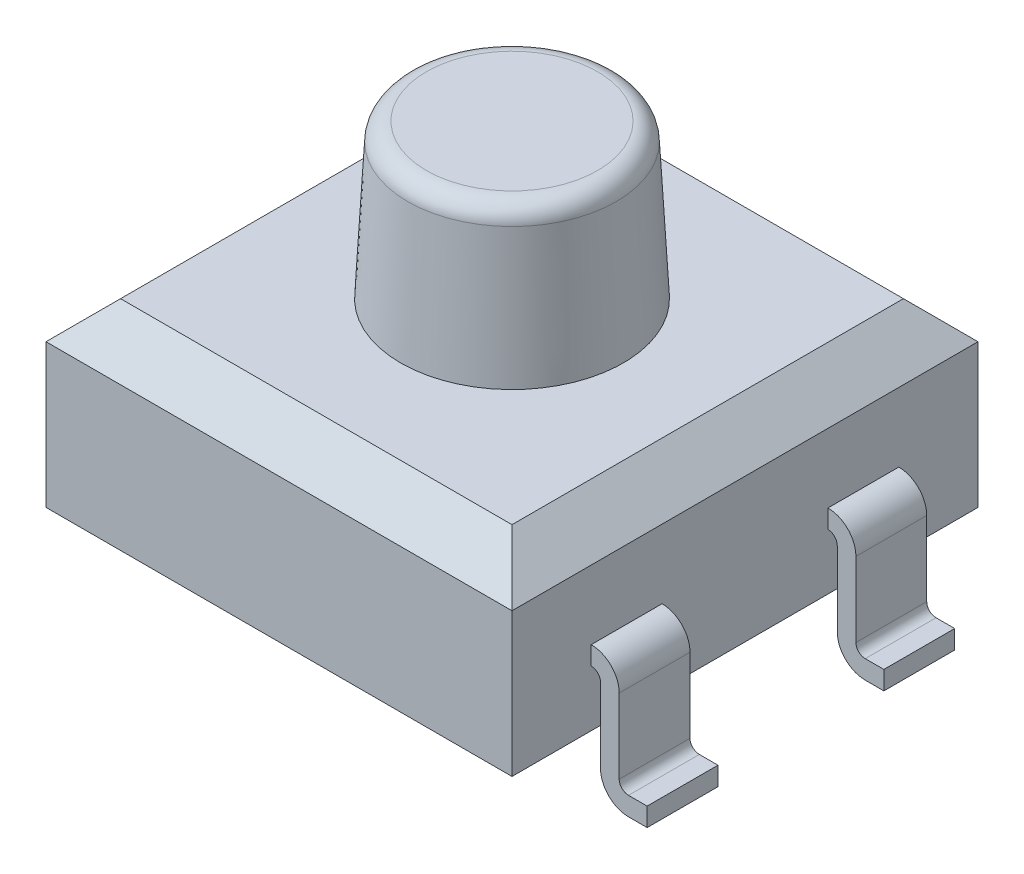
ISO-10303-21;
HEADER;
FILE_DESCRIPTION(('STEP AP214'),'2;1');
FILE_NAME('part.step','',(''),(''),'','','');
FILE_SCHEMA(('AUTOMOTIVE_DESIGN { 1 0 10303 214 1 1 1 1 }'));
ENDSEC;
DATA;
#1=APPLICATION_CONTEXT('core data for automotive mechanical design processes');
#2=APPLICATION_PROTOCOL_DEFINITION('international standard','automotive_design',2000,#1);
#3=PRODUCT_CONTEXT('',#1,'mechanical');
#4=PRODUCT('Part','Part','',(#3));
#5=PRODUCT_RELATED_PRODUCT_CATEGORY('part','',(#4));
#6=PRODUCT_DEFINITION_FORMATION('','',#4);
#7=PRODUCT_DEFINITION_CONTEXT('part definition',#1,'design');
#8=PRODUCT_DEFINITION('design','',#6,#7);
#9=PRODUCT_DEFINITION_SHAPE('','',#8);
#10=(LENGTH_UNIT() NAMED_UNIT(*) SI_UNIT(.MILLI.,.METRE.));
#11=(NAMED_UNIT(*) PLANE_ANGLE_UNIT() SI_UNIT($,.RADIAN.));
#12=(NAMED_UNIT(*) SI_UNIT($,.STERADIAN.) SOLID_ANGLE_UNIT());
#13=UNCERTAINTY_MEASURE_WITH_UNIT(LENGTH_MEASURE(1.E-05),#10,'distance_accuracy_value','');
#14=(GEOMETRIC_REPRESENTATION_CONTEXT(3) GLOBAL_UNCERTAINTY_ASSIGNED_CONTEXT((#13)) GLOBAL_UNIT_ASSIGNED_CONTEXT((#10,
#11,#12)) REPRESENTATION_CONTEXT('',''));
#15=CARTESIAN_POINT('',(0.,0.,0.));
#16=DIRECTION('',(0.,0.,1.));
#17=DIRECTION('',(1.,0.,0.));
#18=AXIS2_PLACEMENT_3D('',#15,#16,#17);
#19=CARTESIAN_POINT('',(2.5,2.54,2.5));
#20=DIRECTION('',(0.,-1.,0.));
#21=DIRECTION('',(0.,0.,-1.));
#22=AXIS2_PLACEMENT_3D('',#19,#20,#21);
#23=PLANE('',#22);
#24=DIRECTION('',(0.,0.,-1.));
#25=VECTOR('',#24,1.);
#26=CARTESIAN_POINT('',(2.1,2.54,2.5));
#27=LINE('',#26,#25);
#28=CARTESIAN_POINT('',(2.1,2.54,2.1));
#29=VERTEX_POINT('',#28);
#30=CARTESIAN_POINT('',(2.1,2.54,-2.1));
#31=VERTEX_POINT('',#30);
#32=EDGE_CURVE('E48',#29,#31,#27,.T.);
#33=ORIENTED_EDGE('',*,*,#32,.T.);
#34=DIRECTION('',(-1.,0.,0.));
#35=VECTOR('',#34,1.);
#36=CARTESIAN_POINT('',(2.5,2.54,-2.1));
#37=LINE('',#36,#35);
#38=CARTESIAN_POINT('',(-2.1,2.54,-2.1));
#39=VERTEX_POINT('',#38);
#40=EDGE_CURVE('E707',#31,#39,#37,.T.);
#41=ORIENTED_EDGE('',*,*,#40,.T.);
#42=DIRECTION('',(0.,0.,1.));
#43=VECTOR('',#42,1.);
#44=CARTESIAN_POINT('',(-2.1,2.54,2.5));
#45=LINE('',#44,#43);
#46=CARTESIAN_POINT('',(-2.1,2.54,2.1));
#47=VERTEX_POINT('',#46);
#48=EDGE_CURVE('E704',#39,#47,#45,.T.);
#49=ORIENTED_EDGE('',*,*,#48,.T.);
#50=DIRECTION('',(1.,0.,0.));
#51=VECTOR('',#50,1.);
#52=CARTESIAN_POINT('',(2.5,2.54,2.1));
#53=LINE('',#52,#51);
#54=EDGE_CURVE('E702',#47,#29,#53,.T.);
#55=ORIENTED_EDGE('',*,*,#54,.T.);
#56=EDGE_LOOP('',(#33,#41,#49,#55));
#57=FACE_BOUND('',#56,.T.);
#58=CARTESIAN_POINT('',(0.,2.54,0.));
#59=DIRECTION('',(0.,-1.,0.));
#60=DIRECTION('',(0.,0.,-1.));
#61=AXIS2_PLACEMENT_3D('',#58,#59,#60);
#62=CIRCLE('',#61,1.195);
#63=CARTESIAN_POINT('',(0.,2.54,-1.195));
#64=VERTEX_POINT('',#63);
#65=EDGE_CURVE('E672',#64,#64,#62,.F.);
#66=ORIENTED_EDGE('',*,*,#65,.F.);
#67=EDGE_LOOP('',(#66));
#68=FACE_BOUND('',#67,.T.);
#69=ADVANCED_FACE('F33',(#57,#68),#23,.F.);
#70=CARTESIAN_POINT('',(2.5,0.2,2.5));
#71=DIRECTION('',(0.,0.,-1.));
#72=DIRECTION('',(-1.,0.,0.));
#73=AXIS2_PLACEMENT_3D('',#70,#71,#72);
#74=PLANE('',#73);
#75=DIRECTION('',(0.,-1.,0.));
#76=VECTOR('',#75,1.);
#77=CARTESIAN_POINT('',(-2.5,0.2,2.5));
#78=LINE('',#77,#76);
#79=CARTESIAN_POINT('',(-2.5,2.14,2.5));
#80=VERTEX_POINT('',#79);
#81=CARTESIAN_POINT('',(-2.5,0.600000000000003,2.5));
#82=VERTEX_POINT('',#81);
#83=EDGE_CURVE('E650',#80,#82,#78,.T.);
#84=ORIENTED_EDGE('',*,*,#83,.T.);
#85=DIRECTION('',(1.,0.,0.));
#86=VECTOR('',#85,1.);
#87=CARTESIAN_POINT('',(2.5,0.600000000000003,2.5));
#88=LINE('',#87,#86);
#89=CARTESIAN_POINT('',(2.5,0.600000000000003,2.5));
#90=VERTEX_POINT('',#89);
#91=EDGE_CURVE('E686',#82,#90,#88,.T.);
#92=ORIENTED_EDGE('',*,*,#91,.T.);
#93=DIRECTION('',(0.,-1.,0.));
#94=VECTOR('',#93,1.);
#95=CARTESIAN_POINT('',(2.5,0.2,2.5));
#96=LINE('',#95,#94);
#97=CARTESIAN_POINT('',(2.5,2.14,2.5));
#98=VERTEX_POINT('',#97);
#99=EDGE_CURVE('E656',#98,#90,#96,.T.);
#100=ORIENTED_EDGE('',*,*,#99,.F.);
#101=DIRECTION('',(-1.,0.,0.));
#102=VECTOR('',#101,1.);
#103=CARTESIAN_POINT('',(2.5,2.14,2.5));
#104=LINE('',#103,#102);
#105=EDGE_CURVE('E684',#98,#80,#104,.T.);
#106=ORIENTED_EDGE('',*,*,#105,.T.);
#107=EDGE_LOOP('',(#84,#92,#100,#106));
#108=FACE_BOUND('',#107,.T.);
#109=ADVANCED_FACE('F741',(#108),#74,.F.);
#110=CARTESIAN_POINT('',(2.5,0.2,2.5));
#111=DIRECTION('',(0.,1.,0.));
#112=DIRECTION('',(0.,0.,1.));
#113=AXIS2_PLACEMENT_3D('',#110,#111,#112);
#114=PLANE('',#113);
#115=DIRECTION('',(0.,0.,1.));
#116=VECTOR('',#115,1.);
#117=CARTESIAN_POINT('',(2.1,0.2,2.5));
#118=LINE('',#117,#116);
#119=CARTESIAN_POINT('',(2.1,0.2,-2.1));
#120=VERTEX_POINT('',#119);
#121=CARTESIAN_POINT('',(2.1,0.2,2.1));
#122=VERTEX_POINT('',#121);
#123=EDGE_CURVE('E679',#120,#122,#118,.T.);
#124=ORIENTED_EDGE('',*,*,#123,.T.);
#125=DIRECTION('',(-1.,0.,0.));
#126=VECTOR('',#125,1.);
#127=CARTESIAN_POINT('',(2.5,0.2,2.1));
#128=LINE('',#127,#126);
#129=CARTESIAN_POINT('',(-2.1,0.2,2.1));
#130=VERTEX_POINT('',#129);
#131=EDGE_CURVE('E681',#122,#130,#128,.T.);
#132=ORIENTED_EDGE('',*,*,#131,.T.);
#133=DIRECTION('',(0.,0.,-1.));
#134=VECTOR('',#133,1.);
#135=CARTESIAN_POINT('',(-2.1,0.2,-2.5));
#136=LINE('',#135,#134);
#137=CARTESIAN_POINT('',(-2.1,0.2,-2.1));
#138=VERTEX_POINT('',#137);
#139=EDGE_CURVE('E675',#130,#138,#136,.T.);
#140=ORIENTED_EDGE('',*,*,#139,.T.);
#141=DIRECTION('',(1.,0.,0.));
#142=VECTOR('',#141,1.);
#143=CARTESIAN_POINT('',(2.5,0.2,-2.1));
#144=LINE('',#143,#142);
#145=EDGE_CURVE('E677',#138,#120,#144,.T.);
#146=ORIENTED_EDGE('',*,*,#145,.T.);
#147=EDGE_LOOP('',(#124,#132,#140,#146));
#148=FACE_BOUND('',#147,.T.);
#149=ADVANCED_FACE('F746',(#148),#114,.F.);
#150=CARTESIAN_POINT('',(2.5,0.2,-2.5));
#151=DIRECTION('',(0.,0.,1.));
#152=DIRECTION('',(1.,0.,0.));
#153=AXIS2_PLACEMENT_3D('',#150,#151,#152);
#154=PLANE('',#153);
#155=DIRECTION('',(0.,1.,0.));
#156=VECTOR('',#155,1.);
#157=CARTESIAN_POINT('',(2.5,0.2,-2.5));
#158=LINE('',#157,#156);
#159=CARTESIAN_POINT('',(2.5,0.600000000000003,-2.5));
#160=VERTEX_POINT('',#159);
#161=CARTESIAN_POINT('',(2.5,2.14,-2.5));
#162=VERTEX_POINT('',#161);
#163=EDGE_CURVE('E659',#160,#162,#158,.T.);
#164=ORIENTED_EDGE('',*,*,#163,.F.);
#165=DIRECTION('',(-1.,0.,0.));
#166=VECTOR('',#165,1.);
#167=CARTESIAN_POINT('',(2.5,0.600000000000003,-2.5));
#168=LINE('',#167,#166);
#169=CARTESIAN_POINT('',(-2.5,0.600000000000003,-2.5));
#170=VERTEX_POINT('',#169);
#171=EDGE_CURVE('E696',#160,#170,#168,.T.);
#172=ORIENTED_EDGE('',*,*,#171,.T.);
#173=DIRECTION('',(0.,1.,0.));
#174=VECTOR('',#173,1.);
#175=CARTESIAN_POINT('',(-2.5,0.2,-2.5));
#176=LINE('',#175,#174);
#177=CARTESIAN_POINT('',(-2.5,2.14,-2.5));
#178=VERTEX_POINT('',#177);
#179=EDGE_CURVE('E653',#170,#178,#176,.T.);
#180=ORIENTED_EDGE('',*,*,#179,.T.);
#181=DIRECTION('',(1.,0.,0.));
#182=VECTOR('',#181,1.);
#183=CARTESIAN_POINT('',(2.5,2.14,-2.5));
#184=LINE('',#183,#182);
#185=EDGE_CURVE('E693',#178,#162,#184,.T.);
#186=ORIENTED_EDGE('',*,*,#185,.T.);
#187=EDGE_LOOP('',(#164,#172,#180,#186));
#188=FACE_BOUND('',#187,.T.);
#189=ADVANCED_FACE('F754',(#188),#154,.F.);
#190=CARTESIAN_POINT('',(2.5,2.54,2.5));
#191=DIRECTION('',(-1.,0.,0.));
#192=DIRECTION('',(0.,0.,1.));
#193=AXIS2_PLACEMENT_3D('',#190,#191,#192);
#194=PLANE('',#193);
#195=DIRECTION('',(0.,0.,1.));
#196=VECTOR('',#195,1.);
#197=CARTESIAN_POINT('',(2.5,1.4,-1.65));
#198=LINE('',#197,#196);
#199=CARTESIAN_POINT('',(2.5,1.4,-1.65));
#200=VERTEX_POINT('',#199);
#201=CARTESIAN_POINT('',(2.5,1.4,-0.89));
#202=VERTEX_POINT('',#201);
#203=EDGE_CURVE('E473',#200,#202,#198,.T.);
#204=ORIENTED_EDGE('',*,*,#203,.F.);
#205=DIRECTION('',(0.,-1.,0.));
#206=VECTOR('',#205,1.);
#207=CARTESIAN_POINT('',(2.5,2.54,-1.65));
#208=LINE('',#207,#206);
#209=CARTESIAN_POINT('',(2.5,1.2,-1.65));
#210=VERTEX_POINT('',#209);
#211=EDGE_CURVE('E507',#200,#210,#208,.T.);
#212=ORIENTED_EDGE('',*,*,#211,.T.);
#213=DIRECTION('',(0.,0.,1.));
#214=VECTOR('',#213,1.);
#215=CARTESIAN_POINT('',(2.5,1.2,-1.65));
#216=LINE('',#215,#214);
#217=CARTESIAN_POINT('',(2.5,1.2,-0.89));
#218=VERTEX_POINT('',#217);
#219=EDGE_CURVE('E498',#210,#218,#216,.T.);
#220=ORIENTED_EDGE('',*,*,#219,.T.);
#221=DIRECTION('',(0.,-1.,0.));
#222=VECTOR('',#221,1.);
#223=CARTESIAN_POINT('',(2.5,2.54,-0.89));
#224=LINE('',#223,#222);
#225=EDGE_CURVE('E352',#202,#218,#224,.T.);
#226=ORIENTED_EDGE('',*,*,#225,.F.);
#227=EDGE_LOOP('',(#204,#212,#220,#226));
#228=FACE_BOUND('',#227,.T.);
#229=DIRECTION('',(0.,0.,-1.));
#230=VECTOR('',#229,1.);
#231=CARTESIAN_POINT('',(2.5,1.2,1.65));
#232=LINE('',#231,#230);
#233=CARTESIAN_POINT('',(2.5,1.2,1.65));
#234=VERTEX_POINT('',#233);
#235=CARTESIAN_POINT('',(2.5,1.2,0.89));
#236=VERTEX_POINT('',#235);
#237=EDGE_CURVE('E598',#234,#236,#232,.T.);
#238=ORIENTED_EDGE('',*,*,#237,.F.);
#239=DIRECTION('',(0.,1.,0.));
#240=VECTOR('',#239,1.);
#241=CARTESIAN_POINT('',(2.5,2.54,1.65));
#242=LINE('',#241,#240);
#243=CARTESIAN_POINT('',(2.5,1.4,1.65));
#244=VERTEX_POINT('',#243);
#245=EDGE_CURVE('E648',#234,#244,#242,.T.);
#246=ORIENTED_EDGE('',*,*,#245,.T.);
#247=DIRECTION('',(0.,0.,-1.));
#248=VECTOR('',#247,1.);
#249=CARTESIAN_POINT('',(2.5,1.4,1.65));
#250=LINE('',#249,#248);
#251=CARTESIAN_POINT('',(2.5,1.4,0.89));
#252=VERTEX_POINT('',#251);
#253=EDGE_CURVE('E631',#244,#252,#250,.T.);
#254=ORIENTED_EDGE('',*,*,#253,.T.);
#255=DIRECTION('',(0.,1.,0.));
#256=VECTOR('',#255,1.);
#257=CARTESIAN_POINT('',(2.5,2.54,0.89));
#258=LINE('',#257,#256);
#259=EDGE_CURVE('E645',#236,#252,#258,.T.);
#260=ORIENTED_EDGE('',*,*,#259,.F.);
#261=EDGE_LOOP('',(#238,#246,#254,#260));
#262=FACE_BOUND('',#261,.T.);
#263=ORIENTED_EDGE('',*,*,#99,.T.);
#264=DIRECTION('',(0.,0.,-1.));
#265=VECTOR('',#264,1.);
#266=CARTESIAN_POINT('',(2.5,0.600000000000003,2.5));
#267=LINE('',#266,#265);
#268=EDGE_CURVE('E691',#90,#160,#267,.T.);
#269=ORIENTED_EDGE('',*,*,#268,.T.);
#270=ORIENTED_EDGE('',*,*,#163,.T.);
#271=DIRECTION('',(0.,0.,1.));
#272=VECTOR('',#271,1.);
#273=CARTESIAN_POINT('',(2.5,2.14,2.5));
#274=LINE('',#273,#272);
#275=EDGE_CURVE('E689',#162,#98,#274,.T.);
#276=ORIENTED_EDGE('',*,*,#275,.T.);
#277=EDGE_LOOP('',(#263,#269,#270,#276));
#278=FACE_BOUND('',#277,.T.);
#279=ADVANCED_FACE('F752',(#228,#262,#278),#194,.F.);
#280=CARTESIAN_POINT('',(-2.5,2.54,2.5));
#281=DIRECTION('',(-1.,0.,0.));
#282=DIRECTION('',(0.,0.,1.));
#283=AXIS2_PLACEMENT_3D('',#280,#281,#282);
#284=PLANE('',#283);
#285=DIRECTION('',(0.,-1.,0.));
#286=VECTOR('',#285,1.);
#287=CARTESIAN_POINT('',(-2.5,2.54,-1.65));
#288=LINE('',#287,#286);
#289=CARTESIAN_POINT('',(-2.5,1.4,-1.65));
#290=VERTEX_POINT('',#289);
#291=CARTESIAN_POINT('',(-2.5,1.2,-1.65));
#292=VERTEX_POINT('',#291);
#293=EDGE_CURVE('E670',#290,#292,#288,.T.);
#294=ORIENTED_EDGE('',*,*,#293,.F.);
#295=DIRECTION('',(0.,0.,1.));
#296=VECTOR('',#295,1.);
#297=CARTESIAN_POINT('',(-2.5,1.4,-1.65));
#298=LINE('',#297,#296);
#299=CARTESIAN_POINT('',(-2.5,1.4,-0.89));
#300=VERTEX_POINT('',#299);
#301=EDGE_CURVE('E476',#290,#300,#298,.T.);
#302=ORIENTED_EDGE('',*,*,#301,.T.);
#303=DIRECTION('',(0.,-1.,0.));
#304=VECTOR('',#303,1.);
#305=CARTESIAN_POINT('',(-2.5,2.54,-0.89));
#306=LINE('',#305,#304);
#307=CARTESIAN_POINT('',(-2.5,1.2,-0.89));
#308=VERTEX_POINT('',#307);
#309=EDGE_CURVE('E667',#300,#308,#306,.T.);
#310=ORIENTED_EDGE('',*,*,#309,.T.);
#311=DIRECTION('',(0.,0.,1.));
#312=VECTOR('',#311,1.);
#313=CARTESIAN_POINT('',(-2.5,1.2,-1.65));
#314=LINE('',#313,#312);
#315=EDGE_CURVE('E495',#292,#308,#314,.T.);
#316=ORIENTED_EDGE('',*,*,#315,.F.);
#317=EDGE_LOOP('',(#294,#302,#310,#316));
#318=FACE_BOUND('',#317,.T.);
#319=DIRECTION('',(0.,1.,0.));
#320=VECTOR('',#319,1.);
#321=CARTESIAN_POINT('',(-2.5,2.54,1.65));
#322=LINE('',#321,#320);
#323=CARTESIAN_POINT('',(-2.5,1.2,1.65));
#324=VERTEX_POINT('',#323);
#325=CARTESIAN_POINT('',(-2.5,1.4,1.65));
#326=VERTEX_POINT('',#325);
#327=EDGE_CURVE('E665',#324,#326,#322,.T.);
#328=ORIENTED_EDGE('',*,*,#327,.F.);
#329=DIRECTION('',(0.,0.,-1.));
#330=VECTOR('',#329,1.);
#331=CARTESIAN_POINT('',(-2.5,1.2,1.65));
#332=LINE('',#331,#330);
#333=CARTESIAN_POINT('',(-2.5,1.2,0.89));
#334=VERTEX_POINT('',#333);
#335=EDGE_CURVE('E601',#324,#334,#332,.T.);
#336=ORIENTED_EDGE('',*,*,#335,.T.);
#337=DIRECTION('',(0.,1.,0.));
#338=VECTOR('',#337,1.);
#339=CARTESIAN_POINT('',(-2.5,2.54,0.89));
#340=LINE('',#339,#338);
#341=CARTESIAN_POINT('',(-2.5,1.4,0.89));
#342=VERTEX_POINT('',#341);
#343=EDGE_CURVE('E662',#334,#342,#340,.T.);
#344=ORIENTED_EDGE('',*,*,#343,.T.);
#345=DIRECTION('',(0.,0.,-1.));
#346=VECTOR('',#345,1.);
#347=CARTESIAN_POINT('',(-2.5,1.4,1.65));
#348=LINE('',#347,#346);
#349=EDGE_CURVE('E628',#326,#342,#348,.T.);
#350=ORIENTED_EDGE('',*,*,#349,.F.);
#351=EDGE_LOOP('',(#328,#336,#344,#350));
#352=FACE_BOUND('',#351,.T.);
#353=ORIENTED_EDGE('',*,*,#179,.F.);
#354=DIRECTION('',(0.,0.,1.));
#355=VECTOR('',#354,1.);
#356=CARTESIAN_POINT('',(-2.5,0.600000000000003,2.5));
#357=LINE('',#356,#355);
#358=EDGE_CURVE('E700',#170,#82,#357,.T.);
#359=ORIENTED_EDGE('',*,*,#358,.T.);
#360=ORIENTED_EDGE('',*,*,#83,.F.);
#361=DIRECTION('',(0.,0.,-1.));
#362=VECTOR('',#361,1.);
#363=CARTESIAN_POINT('',(-2.5,2.14,-2.5));
#364=LINE('',#363,#362);
#365=EDGE_CURVE('E698',#80,#178,#364,.T.);
#366=ORIENTED_EDGE('',*,*,#365,.T.);
#367=EDGE_LOOP('',(#353,#359,#360,#366));
#368=FACE_BOUND('',#367,.T.);
#369=ADVANCED_FACE('F796',(#318,#352,#368),#284,.T.);
#370=CARTESIAN_POINT('',(-2.8,1.1,1.65));
#371=DIRECTION('',(1.,0.,0.));
#372=DIRECTION('',(0.,1.,0.));
#373=AXIS2_PLACEMENT_3D('',#370,#371,#372);
#374=PLANE('',#373);
#375=DIRECTION('',(0.,-1.,0.));
#376=VECTOR('',#375,1.);
#377=CARTESIAN_POINT('',(-2.8,1.1,0.89));
#378=LINE('',#377,#376);
#379=CARTESIAN_POINT('',(-2.8,1.1,0.89));
#380=VERTEX_POINT('',#379);
#381=CARTESIAN_POINT('',(-2.8,0.3,0.89));
#382=VERTEX_POINT('',#381);
#383=EDGE_CURVE('E563',#380,#382,#378,.T.);
#384=ORIENTED_EDGE('',*,*,#383,.T.);
#385=DIRECTION('',(0.,0.,-1.));
#386=VECTOR('',#385,1.);
#387=CARTESIAN_POINT('',(-2.8,0.3,1.65));
#388=LINE('',#387,#386);
#389=CARTESIAN_POINT('',(-2.8,0.3,1.65));
#390=VERTEX_POINT('',#389);
#391=EDGE_CURVE('E622',#390,#382,#388,.T.);
#392=ORIENTED_EDGE('',*,*,#391,.F.);
#393=DIRECTION('',(0.,-1.,0.));
#394=VECTOR('',#393,1.);
#395=CARTESIAN_POINT('',(-2.8,1.1,1.65));
#396=LINE('',#395,#394);
#397=CARTESIAN_POINT('',(-2.8,1.1,1.65));
#398=VERTEX_POINT('',#397);
#399=EDGE_CURVE('E525',#398,#390,#396,.T.);
#400=ORIENTED_EDGE('',*,*,#399,.F.);
#401=DIRECTION('',(0.,0.,-1.));
#402=VECTOR('',#401,1.);
#403=CARTESIAN_POINT('',(-2.8,1.1,1.65));
#404=LINE('',#403,#402);
#405=EDGE_CURVE('E625',#398,#380,#404,.T.);
#406=ORIENTED_EDGE('',*,*,#405,.T.);
#407=EDGE_LOOP('',(#384,#392,#400,#406));
#408=FACE_BOUND('',#407,.T.);
#409=ADVANCED_FACE('F818',(#408),#374,.F.);
#410=CARTESIAN_POINT('',(-2.9,0.3,1.65));
#411=DIRECTION('',(0.,0.,-1.));
#412=DIRECTION('',(-1.,0.,0.));
#413=AXIS2_PLACEMENT_3D('',#410,#411,#412);
#414=CYLINDRICAL_SURFACE('',#413,0.1);
#415=CARTESIAN_POINT('',(-2.9,0.3,0.89));
#416=DIRECTION('',(0.,0.,-1.));
#417=DIRECTION('',(-1.,0.,0.));
#418=AXIS2_PLACEMENT_3D('',#415,#416,#417);
#419=CIRCLE('',#418,0.1);
#420=CARTESIAN_POINT('',(-2.9,0.2,0.89));
#421=VERTEX_POINT('',#420);
#422=EDGE_CURVE('E565',#382,#421,#419,.T.);
#423=ORIENTED_EDGE('',*,*,#422,.T.);
#424=DIRECTION('',(0.,0.,-1.));
#425=VECTOR('',#424,1.);
#426=CARTESIAN_POINT('',(-2.9,0.2,1.65));
#427=LINE('',#426,#425);
#428=CARTESIAN_POINT('',(-2.9,0.2,1.65));
#429=VERTEX_POINT('',#428);
#430=EDGE_CURVE('E619',#429,#421,#427,.T.);
#431=ORIENTED_EDGE('',*,*,#430,.F.);
#432=CARTESIAN_POINT('',(-2.9,0.3,1.65));
#433=DIRECTION('',(0.,0.,-1.));
#434=DIRECTION('',(-1.,0.,0.));
#435=AXIS2_PLACEMENT_3D('',#432,#433,#434);
#436=CIRCLE('',#435,0.1);
#437=EDGE_CURVE('E527',#390,#429,#436,.T.);
#438=ORIENTED_EDGE('',*,*,#437,.F.);
#439=ORIENTED_EDGE('',*,*,#391,.T.);
#440=EDGE_LOOP('',(#423,#431,#438,#439));
#441=FACE_BOUND('',#440,.T.);
#442=ADVANCED_FACE('F912',(#441),#414,.F.);
#443=CARTESIAN_POINT('',(-2.9,0.2,1.65));
#444=DIRECTION('',(0.,-1.,0.));
#445=DIRECTION('',(0.,0.,-1.));
#446=AXIS2_PLACEMENT_3D('',#443,#444,#445);
#447=PLANE('',#446);
#448=DIRECTION('',(-1.,0.,0.));
#449=VECTOR('',#448,1.);
#450=CARTESIAN_POINT('',(-2.9,0.2,0.89));
#451=LINE('',#450,#449);
#452=CARTESIAN_POINT('',(-3.1,0.2,0.89));
#453=VERTEX_POINT('',#452);
#454=EDGE_CURVE('E567',#421,#453,#451,.T.);
#455=ORIENTED_EDGE('',*,*,#454,.T.);
#456=DIRECTION('',(0.,0.,-1.));
#457=VECTOR('',#456,1.);
#458=CARTESIAN_POINT('',(-3.1,0.2,1.65));
#459=LINE('',#458,#457);
#460=CARTESIAN_POINT('',(-3.1,0.2,1.65));
#461=VERTEX_POINT('',#460);
#462=EDGE_CURVE('E616',#461,#453,#459,.T.);
#463=ORIENTED_EDGE('',*,*,#462,.F.);
#464=DIRECTION('',(-1.,0.,0.));
#465=VECTOR('',#464,1.);
#466=CARTESIAN_POINT('',(-2.9,0.2,1.65));
#467=LINE('',#466,#465);
#468=EDGE_CURVE('E529',#429,#461,#467,.T.);
#469=ORIENTED_EDGE('',*,*,#468,.F.);
#470=ORIENTED_EDGE('',*,*,#430,.T.);
#471=EDGE_LOOP('',(#455,#463,#469,#470));
#472=FACE_BOUND('',#471,.T.);
#473=ADVANCED_FACE('F916',(#472),#447,.F.);
#474=CARTESIAN_POINT('',(-3.1,0.,1.65));
#475=DIRECTION('',(1.,0.,0.));
#476=DIRECTION('',(0.,0.,-1.));
#477=AXIS2_PLACEMENT_3D('',#474,#475,#476);
#478=PLANE('',#477);
#479=DIRECTION('',(0.,-1.,0.));
#480=VECTOR('',#479,1.);
#481=CARTESIAN_POINT('',(-3.1,0.,0.89));
#482=LINE('',#481,#480);
#483=CARTESIAN_POINT('',(-3.1,0.,0.89));
#484=VERTEX_POINT('',#483);
#485=EDGE_CURVE('E569',#453,#484,#482,.T.);
#486=ORIENTED_EDGE('',*,*,#485,.T.);
#487=DIRECTION('',(0.,0.,-1.));
#488=VECTOR('',#487,1.);
#489=CARTESIAN_POINT('',(-3.1,0.,1.65));
#490=LINE('',#489,#488);
#491=CARTESIAN_POINT('',(-3.1,0.,1.65));
#492=VERTEX_POINT('',#491);
#493=EDGE_CURVE('E613',#492,#484,#490,.T.);
#494=ORIENTED_EDGE('',*,*,#493,.F.);
#495=DIRECTION('',(0.,-1.,0.));
#496=VECTOR('',#495,1.);
#497=CARTESIAN_POINT('',(-3.1,0.,1.65));
#498=LINE('',#497,#496);
#499=EDGE_CURVE('E531',#461,#492,#498,.T.);
#500=ORIENTED_EDGE('',*,*,#499,.F.);
#501=ORIENTED_EDGE('',*,*,#462,.T.);
#502=EDGE_LOOP('',(#486,#494,#500,#501));
#503=FACE_BOUND('',#502,.T.);
#504=ADVANCED_FACE('F921',(#503),#478,.F.);
#505=CARTESIAN_POINT('',(-2.9,0.,1.65));
#506=DIRECTION('',(0.,1.,0.));
#507=DIRECTION('',(-1.,0.,0.));
#508=AXIS2_PLACEMENT_3D('',#505,#506,#507);
#509=PLANE('',#508);
#510=DIRECTION('',(1.,0.,0.));
#511=VECTOR('',#510,1.);
#512=CARTESIAN_POINT('',(-2.9,0.,0.89));
#513=LINE('',#512,#511);
#514=CARTESIAN_POINT('',(-2.9,0.,0.89));
#515=VERTEX_POINT('',#514);
#516=EDGE_CURVE('E571',#484,#515,#513,.T.);
#517=ORIENTED_EDGE('',*,*,#516,.T.);
#518=DIRECTION('',(0.,0.,-1.));
#519=VECTOR('',#518,1.);
#520=CARTESIAN_POINT('',(-2.9,0.,1.65));
#521=LINE('',#520,#519);
#522=CARTESIAN_POINT('',(-2.9,0.,1.65));
#523=VERTEX_POINT('',#522);
#524=EDGE_CURVE('E610',#523,#515,#521,.T.);
#525=ORIENTED_EDGE('',*,*,#524,.F.);
#526=DIRECTION('',(1.,0.,0.));
#527=VECTOR('',#526,1.);
#528=CARTESIAN_POINT('',(-2.9,0.,1.65));
#529=LINE('',#528,#527);
#530=EDGE_CURVE('E533',#492,#523,#529,.T.);
#531=ORIENTED_EDGE('',*,*,#530,.F.);
#532=ORIENTED_EDGE('',*,*,#493,.T.);
#533=EDGE_LOOP('',(#517,#525,#531,#532));
#534=FACE_BOUND('',#533,.T.);
#535=ADVANCED_FACE('F927',(#534),#509,.F.);
#536=CARTESIAN_POINT('',(-2.9,0.3,1.65));
#537=DIRECTION('',(0.,0.,-1.));
#538=DIRECTION('',(-1.,0.,0.));
#539=AXIS2_PLACEMENT_3D('',#536,#537,#538);
#540=CYLINDRICAL_SURFACE('',#539,0.3);
#541=CARTESIAN_POINT('',(-2.9,0.3,0.89));
#542=DIRECTION('',(0.,0.,1.));
#543=DIRECTION('',(-1.,0.,0.));
#544=AXIS2_PLACEMENT_3D('',#541,#542,#543);
#545=CIRCLE('',#544,0.3);
#546=CARTESIAN_POINT('',(-2.6,0.3,0.89));
#547=VERTEX_POINT('',#546);
#548=EDGE_CURVE('E573',#515,#547,#545,.T.);
#549=ORIENTED_EDGE('',*,*,#548,.T.);
#550=DIRECTION('',(0.,0.,-1.));
#551=VECTOR('',#550,1.);
#552=CARTESIAN_POINT('',(-2.6,0.3,1.65));
#553=LINE('',#552,#551);
#554=CARTESIAN_POINT('',(-2.6,0.3,1.65));
#555=VERTEX_POINT('',#554);
#556=EDGE_CURVE('E607',#555,#547,#553,.T.);
#557=ORIENTED_EDGE('',*,*,#556,.F.);
#558=CARTESIAN_POINT('',(-2.9,0.3,1.65));
#559=DIRECTION('',(0.,0.,1.));
#560=DIRECTION('',(-1.,0.,0.));
#561=AXIS2_PLACEMENT_3D('',#558,#559,#560);
#562=CIRCLE('',#561,0.3);
#563=EDGE_CURVE('E535',#523,#555,#562,.T.);
#564=ORIENTED_EDGE('',*,*,#563,.F.);
#565=ORIENTED_EDGE('',*,*,#524,.T.);
#566=EDGE_LOOP('',(#549,#557,#564,#565));
#567=FACE_BOUND('',#566,.T.);
#568=ADVANCED_FACE('F931',(#567),#540,.T.);
#569=CARTESIAN_POINT('',(-2.6,1.1,1.65));
#570=DIRECTION('',(-1.,0.,0.));
#571=DIRECTION('',(0.,0.,1.));
#572=AXIS2_PLACEMENT_3D('',#569,#570,#571);
#573=PLANE('',#572);
#574=DIRECTION('',(0.,1.,0.));
#575=VECTOR('',#574,1.);
#576=CARTESIAN_POINT('',(-2.6,1.1,0.89));
#577=LINE('',#576,#575);
#578=CARTESIAN_POINT('',(-2.6,1.1,0.89));
#579=VERTEX_POINT('',#578);
#580=EDGE_CURVE('E575',#547,#579,#577,.T.);
#581=ORIENTED_EDGE('',*,*,#580,.T.);
#582=DIRECTION('',(0.,0.,-1.));
#583=VECTOR('',#582,1.);
#584=CARTESIAN_POINT('',(-2.6,1.1,1.65));
#585=LINE('',#584,#583);
#586=CARTESIAN_POINT('',(-2.6,1.1,1.65));
#587=VERTEX_POINT('',#586);
#588=EDGE_CURVE('E604',#587,#579,#585,.T.);
#589=ORIENTED_EDGE('',*,*,#588,.F.);
#590=DIRECTION('',(0.,1.,0.));
#591=VECTOR('',#590,1.);
#592=CARTESIAN_POINT('',(-2.6,1.1,1.65));
#593=LINE('',#592,#591);
#594=EDGE_CURVE('E537',#555,#587,#593,.T.);
#595=ORIENTED_EDGE('',*,*,#594,.F.);
#596=ORIENTED_EDGE('',*,*,#556,.T.);
#597=EDGE_LOOP('',(#581,#589,#595,#596));
#598=FACE_BOUND('',#597,.T.);
#599=ADVANCED_FACE('F890',(#598),#573,.F.);
#600=CARTESIAN_POINT('',(2.9,0.3,1.65));
#601=DIRECTION('',(0.,0.,1.));
#602=DIRECTION('',(1.,0.,0.));
#603=AXIS2_PLACEMENT_3D('',#600,#601,#602);
#604=PLANE('',#603);
#605=CARTESIAN_POINT('',(-2.5,1.1,1.65));
#606=DIRECTION('',(0.,0.,-1.));
#607=DIRECTION('',(1.,0.,0.));
#608=AXIS2_PLACEMENT_3D('',#605,#606,#607);
#609=CIRCLE('',#608,0.0999999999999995);
#610=EDGE_CURVE('E539',#587,#324,#609,.T.);
#611=ORIENTED_EDGE('',*,*,#610,.T.);
#612=ORIENTED_EDGE('',*,*,#327,.T.);
#613=CARTESIAN_POINT('',(-2.5,1.1,1.65));
#614=DIRECTION('',(0.,0.,1.));
#615=DIRECTION('',(1.,0.,0.));
#616=AXIS2_PLACEMENT_3D('',#613,#614,#615);
#617=CIRCLE('',#616,0.299999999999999);
#618=EDGE_CURVE('E523',#326,#398,#617,.T.);
#619=ORIENTED_EDGE('',*,*,#618,.T.);
#620=ORIENTED_EDGE('',*,*,#399,.T.);
#621=ORIENTED_EDGE('',*,*,#437,.T.);
#622=ORIENTED_EDGE('',*,*,#468,.T.);
#623=ORIENTED_EDGE('',*,*,#499,.T.);
#624=ORIENTED_EDGE('',*,*,#530,.T.);
#625=ORIENTED_EDGE('',*,*,#563,.T.);
#626=ORIENTED_EDGE('',*,*,#594,.T.);
#627=EDGE_LOOP('',(#611,#612,#619,#620,#621,#622,#623,#624,#625,#626));
#628=FACE_BOUND('',#627,.T.);
#629=ADVANCED_FACE('F879',(#628),#604,.T.);
#630=CARTESIAN_POINT('',(2.9,0.3,0.89));
#631=DIRECTION('',(0.,0.,1.));
#632=DIRECTION('',(1.,0.,0.));
#633=AXIS2_PLACEMENT_3D('',#630,#631,#632);
#634=PLANE('',#633);
#635=ORIENTED_EDGE('',*,*,#343,.F.);
#636=CARTESIAN_POINT('',(-2.5,1.1,0.89));
#637=DIRECTION('',(0.,0.,-1.));
#638=DIRECTION('',(1.,0.,0.));
#639=AXIS2_PLACEMENT_3D('',#636,#637,#638);
#640=CIRCLE('',#639,0.0999999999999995);
#641=EDGE_CURVE('E577',#579,#334,#640,.T.);
#642=ORIENTED_EDGE('',*,*,#641,.F.);
#643=ORIENTED_EDGE('',*,*,#580,.F.);
#644=ORIENTED_EDGE('',*,*,#548,.F.);
#645=ORIENTED_EDGE('',*,*,#516,.F.);
#646=ORIENTED_EDGE('',*,*,#485,.F.);
#647=ORIENTED_EDGE('',*,*,#454,.F.);
#648=ORIENTED_EDGE('',*,*,#422,.F.);
#649=ORIENTED_EDGE('',*,*,#383,.F.);
#650=CARTESIAN_POINT('',(-2.5,1.1,0.89));
#651=DIRECTION('',(0.,0.,1.));
#652=DIRECTION('',(1.,0.,0.));
#653=AXIS2_PLACEMENT_3D('',#650,#651,#652);
#654=CIRCLE('',#653,0.299999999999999);
#655=EDGE_CURVE('E561',#342,#380,#654,.T.);
#656=ORIENTED_EDGE('',*,*,#655,.F.);
#657=EDGE_LOOP('',(#635,#642,#643,#644,#645,#646,#647,#648,#649,#656));
#658=FACE_BOUND('',#657,.T.);
#659=ADVANCED_FACE('F871',(#658),#634,.F.);
#660=CARTESIAN_POINT('',(-2.5,1.1,1.65));
#661=DIRECTION('',(0.,0.,-1.));
#662=DIRECTION('',(-1.,0.,0.));
#663=AXIS2_PLACEMENT_3D('',#660,#661,#662);
#664=CYLINDRICAL_SURFACE('',#663,0.0999999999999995);
#665=ORIENTED_EDGE('',*,*,#641,.T.);
#666=ORIENTED_EDGE('',*,*,#335,.F.);
#667=ORIENTED_EDGE('',*,*,#610,.F.);
#668=ORIENTED_EDGE('',*,*,#588,.T.);
#669=EDGE_LOOP('',(#665,#666,#667,#668));
#670=FACE_BOUND('',#669,.T.);
#671=ADVANCED_FACE('F882',(#670),#664,.F.);
#672=CARTESIAN_POINT('',(-2.5,1.1,1.65));
#673=DIRECTION('',(0.,0.,-1.));
#674=DIRECTION('',(-1.,0.,0.));
#675=AXIS2_PLACEMENT_3D('',#672,#673,#674);
#676=CYLINDRICAL_SURFACE('',#675,0.299999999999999);
#677=ORIENTED_EDGE('',*,*,#655,.T.);
#678=ORIENTED_EDGE('',*,*,#405,.F.);
#679=ORIENTED_EDGE('',*,*,#618,.F.);
#680=ORIENTED_EDGE('',*,*,#349,.T.);
#681=EDGE_LOOP('',(#677,#678,#679,#680));
#682=FACE_BOUND('',#681,.T.);
#683=ADVANCED_FACE('F877',(#682),#676,.T.);
#684=ORIENTED_EDGE('',*,*,#245,.F.);
#685=CARTESIAN_POINT('',(2.5,1.1,1.65));
#686=DIRECTION('',(0.,0.,-1.));
#687=DIRECTION('',(-1.,0.,0.));
#688=AXIS2_PLACEMENT_3D('',#685,#686,#687);
#689=CIRCLE('',#688,0.0999999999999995);
#690=CARTESIAN_POINT('',(2.6,1.1,1.65));
#691=VERTEX_POINT('',#690);
#692=EDGE_CURVE('E541',#234,#691,#689,.T.);
#693=ORIENTED_EDGE('',*,*,#692,.T.);
#694=DIRECTION('',(0.,-1.,0.));
#695=VECTOR('',#694,1.);
#696=CARTESIAN_POINT('',(2.6,1.1,1.65));
#697=LINE('',#696,#695);
#698=CARTESIAN_POINT('',(2.6,0.3,1.65));
#699=VERTEX_POINT('',#698);
#700=EDGE_CURVE('E543',#691,#699,#697,.T.);
#701=ORIENTED_EDGE('',*,*,#700,.T.);
#702=CARTESIAN_POINT('',(2.9,0.3,1.65));
#703=DIRECTION('',(0.,0.,1.));
#704=DIRECTION('',(1.,0.,0.));
#705=AXIS2_PLACEMENT_3D('',#702,#703,#704);
#706=CIRCLE('',#705,0.3);
#707=CARTESIAN_POINT('',(2.9,0.,1.65));
#708=VERTEX_POINT('',#707);
#709=EDGE_CURVE('E545',#699,#708,#706,.T.);
#710=ORIENTED_EDGE('',*,*,#709,.T.);
#711=DIRECTION('',(1.,0.,0.));
#712=VECTOR('',#711,1.);
#713=CARTESIAN_POINT('',(2.9,0.,1.65));
#714=LINE('',#713,#712);
#715=CARTESIAN_POINT('',(3.1,0.,1.65));
#716=VERTEX_POINT('',#715);
#717=EDGE_CURVE('E547',#708,#716,#714,.T.);
#718=ORIENTED_EDGE('',*,*,#717,.T.);
#719=DIRECTION('',(0.,1.,0.));
#720=VECTOR('',#719,1.);
#721=CARTESIAN_POINT('',(3.1,0.,1.65));
#722=LINE('',#721,#720);
#723=CARTESIAN_POINT('',(3.1,0.2,1.65));
#724=VERTEX_POINT('',#723);
#725=EDGE_CURVE('E510',#716,#724,#722,.T.);
#726=ORIENTED_EDGE('',*,*,#725,.T.);
#727=DIRECTION('',(-1.,0.,0.));
#728=VECTOR('',#727,1.);
#729=CARTESIAN_POINT('',(2.9,0.2,1.65));
#730=LINE('',#729,#728);
#731=CARTESIAN_POINT('',(2.9,0.2,1.65));
#732=VERTEX_POINT('',#731);
#733=EDGE_CURVE('E513',#724,#732,#730,.T.);
#734=ORIENTED_EDGE('',*,*,#733,.T.);
#735=CARTESIAN_POINT('',(2.9,0.3,1.65));
#736=DIRECTION('',(0.,0.,-1.));
#737=DIRECTION('',(1.,0.,0.));
#738=AXIS2_PLACEMENT_3D('',#735,#736,#737);
#739=CIRCLE('',#738,0.1);
#740=CARTESIAN_POINT('',(2.8,0.3,1.65));
#741=VERTEX_POINT('',#740);
#742=EDGE_CURVE('E516',#732,#741,#739,.T.);
#743=ORIENTED_EDGE('',*,*,#742,.T.);
#744=DIRECTION('',(0.,1.,0.));
#745=VECTOR('',#744,1.);
#746=CARTESIAN_POINT('',(2.8,1.1,1.65));
#747=LINE('',#746,#745);
#748=CARTESIAN_POINT('',(2.8,1.1,1.65));
#749=VERTEX_POINT('',#748);
#750=EDGE_CURVE('E518',#741,#749,#747,.T.);
#751=ORIENTED_EDGE('',*,*,#750,.T.);
#752=CARTESIAN_POINT('',(2.5,1.1,1.65));
#753=DIRECTION('',(0.,0.,1.));
#754=DIRECTION('',(-1.,0.,0.));
#755=AXIS2_PLACEMENT_3D('',#752,#753,#754);
#756=CIRCLE('',#755,0.3);
#757=EDGE_CURVE('E520',#749,#244,#756,.T.);
#758=ORIENTED_EDGE('',*,*,#757,.T.);
#759=EDGE_LOOP('',(#684,#693,#701,#710,#718,#726,#734,#743,#751,#758));
#760=FACE_BOUND('',#759,.T.);
#761=ADVANCED_FACE('F826',(#760),#604,.T.);
#762=CARTESIAN_POINT('',(2.5,1.1,0.89));
#763=DIRECTION('',(0.,0.,-1.));
#764=DIRECTION('',(-1.,0.,0.));
#765=AXIS2_PLACEMENT_3D('',#762,#763,#764);
#766=CIRCLE('',#765,0.0999999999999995);
#767=CARTESIAN_POINT('',(2.6,1.1,0.89));
#768=VERTEX_POINT('',#767);
#769=EDGE_CURVE('E580',#236,#768,#766,.T.);
#770=ORIENTED_EDGE('',*,*,#769,.F.);
#771=ORIENTED_EDGE('',*,*,#259,.T.);
#772=CARTESIAN_POINT('',(2.5,1.1,0.89));
#773=DIRECTION('',(0.,0.,1.));
#774=DIRECTION('',(-1.,0.,0.));
#775=AXIS2_PLACEMENT_3D('',#772,#773,#774);
#776=CIRCLE('',#775,0.3);
#777=CARTESIAN_POINT('',(2.8,1.1,0.89));
#778=VERTEX_POINT('',#777);
#779=EDGE_CURVE('E558',#778,#252,#776,.T.);
#780=ORIENTED_EDGE('',*,*,#779,.F.);
#781=DIRECTION('',(0.,1.,0.));
#782=VECTOR('',#781,1.);
#783=CARTESIAN_POINT('',(2.8,1.1,0.89));
#784=LINE('',#783,#782);
#785=CARTESIAN_POINT('',(2.8,0.3,0.89));
#786=VERTEX_POINT('',#785);
#787=EDGE_CURVE('E556',#786,#778,#784,.T.);
#788=ORIENTED_EDGE('',*,*,#787,.F.);
#789=CARTESIAN_POINT('',(2.9,0.3,0.89));
#790=DIRECTION('',(0.,0.,-1.));
#791=DIRECTION('',(1.,0.,0.));
#792=AXIS2_PLACEMENT_3D('',#789,#790,#791);
#793=CIRCLE('',#792,0.1);
#794=CARTESIAN_POINT('',(2.9,0.2,0.89));
#795=VERTEX_POINT('',#794);
#796=EDGE_CURVE('E554',#795,#786,#793,.T.);
#797=ORIENTED_EDGE('',*,*,#796,.F.);
#798=DIRECTION('',(-1.,0.,0.));
#799=VECTOR('',#798,1.);
#800=CARTESIAN_POINT('',(2.9,0.2,0.89));
#801=LINE('',#800,#799);
#802=CARTESIAN_POINT('',(3.1,0.2,0.89));
#803=VERTEX_POINT('',#802);
#804=EDGE_CURVE('E552',#803,#795,#801,.T.);
#805=ORIENTED_EDGE('',*,*,#804,.F.);
#806=DIRECTION('',(0.,1.,0.));
#807=VECTOR('',#806,1.);
#808=CARTESIAN_POINT('',(3.1,0.,0.89));
#809=LINE('',#808,#807);
#810=CARTESIAN_POINT('',(3.1,0.,0.89));
#811=VERTEX_POINT('',#810);
#812=EDGE_CURVE('E509',#811,#803,#809,.T.);
#813=ORIENTED_EDGE('',*,*,#812,.F.);
#814=DIRECTION('',(1.,0.,0.));
#815=VECTOR('',#814,1.);
#816=CARTESIAN_POINT('',(2.9,0.,0.89));
#817=LINE('',#816,#815);
#818=CARTESIAN_POINT('',(2.9,0.,0.89));
#819=VERTEX_POINT('',#818);
#820=EDGE_CURVE('E514',#819,#811,#817,.T.);
#821=ORIENTED_EDGE('',*,*,#820,.F.);
#822=CARTESIAN_POINT('',(2.9,0.3,0.89));
#823=DIRECTION('',(0.,0.,1.));
#824=DIRECTION('',(1.,0.,0.));
#825=AXIS2_PLACEMENT_3D('',#822,#823,#824);
#826=CIRCLE('',#825,0.3);
#827=CARTESIAN_POINT('',(2.6,0.3,0.89));
#828=VERTEX_POINT('',#827);
#829=EDGE_CURVE('E584',#828,#819,#826,.T.);
#830=ORIENTED_EDGE('',*,*,#829,.F.);
#831=DIRECTION('',(0.,-1.,0.));
#832=VECTOR('',#831,1.);
#833=CARTESIAN_POINT('',(2.6,1.1,0.89));
#834=LINE('',#833,#832);
#835=EDGE_CURVE('E582',#768,#828,#834,.T.);
#836=ORIENTED_EDGE('',*,*,#835,.F.);
#837=EDGE_LOOP('',(#770,#771,#780,#788,#797,#805,#813,#821,#830,#836));
#838=FACE_BOUND('',#837,.T.);
#839=ADVANCED_FACE('F868',(#838),#634,.F.);
#840=CARTESIAN_POINT('',(3.1,0.,1.65));
#841=DIRECTION('',(-1.,0.,0.));
#842=DIRECTION('',(0.,0.,1.));
#843=AXIS2_PLACEMENT_3D('',#840,#841,#842);
#844=PLANE('',#843);
#845=ORIENTED_EDGE('',*,*,#812,.T.);
#846=DIRECTION('',(0.,0.,-1.));
#847=VECTOR('',#846,1.);
#848=CARTESIAN_POINT('',(3.1,0.2,1.65));
#849=LINE('',#848,#847);
#850=EDGE_CURVE('E642',#724,#803,#849,.T.);
#851=ORIENTED_EDGE('',*,*,#850,.F.);
#852=ORIENTED_EDGE('',*,*,#725,.F.);
#853=DIRECTION('',(0.,0.,-1.));
#854=VECTOR('',#853,1.);
#855=CARTESIAN_POINT('',(3.1,0.,1.65));
#856=LINE('',#855,#854);
#857=EDGE_CURVE('E549',#716,#811,#856,.T.);
#858=ORIENTED_EDGE('',*,*,#857,.T.);
#859=EDGE_LOOP('',(#845,#851,#852,#858));
#860=FACE_BOUND('',#859,.T.);
#861=ADVANCED_FACE('F850',(#860),#844,.F.);
#862=CARTESIAN_POINT('',(2.9,0.2,1.65));
#863=DIRECTION('',(0.,-1.,0.));
#864=DIRECTION('',(1.,0.,0.));
#865=AXIS2_PLACEMENT_3D('',#862,#863,#864);
#866=PLANE('',#865);
#867=ORIENTED_EDGE('',*,*,#804,.T.);
#868=DIRECTION('',(0.,0.,-1.));
#869=VECTOR('',#868,1.);
#870=CARTESIAN_POINT('',(2.9,0.2,1.65));
#871=LINE('',#870,#869);
#872=EDGE_CURVE('E639',#732,#795,#871,.T.);
#873=ORIENTED_EDGE('',*,*,#872,.F.);
#874=ORIENTED_EDGE('',*,*,#733,.F.);
#875=ORIENTED_EDGE('',*,*,#850,.T.);
#876=EDGE_LOOP('',(#867,#873,#874,#875));
#877=FACE_BOUND('',#876,.T.);
#878=ADVANCED_FACE('F855',(#877),#866,.F.);
#879=CARTESIAN_POINT('',(2.9,0.3,1.65));
#880=DIRECTION('',(0.,0.,-1.));
#881=DIRECTION('',(-1.,0.,0.));
#882=AXIS2_PLACEMENT_3D('',#879,#880,#881);
#883=CYLINDRICAL_SURFACE('',#882,0.1);
#884=ORIENTED_EDGE('',*,*,#796,.T.);
#885=DIRECTION('',(0.,0.,-1.));
#886=VECTOR('',#885,1.);
#887=CARTESIAN_POINT('',(2.8,0.3,1.65));
#888=LINE('',#887,#886);
#889=EDGE_CURVE('E636',#741,#786,#888,.T.);
#890=ORIENTED_EDGE('',*,*,#889,.F.);
#891=ORIENTED_EDGE('',*,*,#742,.F.);
#892=ORIENTED_EDGE('',*,*,#872,.T.);
#893=EDGE_LOOP('',(#884,#890,#891,#892));
#894=FACE_BOUND('',#893,.T.);
#895=ADVANCED_FACE('F858',(#894),#883,.F.);
#896=CARTESIAN_POINT('',(2.8,1.1,1.65));
#897=DIRECTION('',(-1.,0.,0.));
#898=DIRECTION('',(0.,-1.,0.));
#899=AXIS2_PLACEMENT_3D('',#896,#897,#898);
#900=PLANE('',#899);
#901=ORIENTED_EDGE('',*,*,#787,.T.);
#902=DIRECTION('',(0.,0.,-1.));
#903=VECTOR('',#902,1.);
#904=CARTESIAN_POINT('',(2.8,1.1,1.65));
#905=LINE('',#904,#903);
#906=EDGE_CURVE('E633',#749,#778,#905,.T.);
#907=ORIENTED_EDGE('',*,*,#906,.F.);
#908=ORIENTED_EDGE('',*,*,#750,.F.);
#909=ORIENTED_EDGE('',*,*,#889,.T.);
#910=EDGE_LOOP('',(#901,#907,#908,#909));
#911=FACE_BOUND('',#910,.T.);
#912=ADVANCED_FACE('F863',(#911),#900,.F.);
#913=CARTESIAN_POINT('',(2.5,1.1,1.65));
#914=DIRECTION('',(0.,0.,-1.));
#915=DIRECTION('',(-1.,0.,0.));
#916=AXIS2_PLACEMENT_3D('',#913,#914,#915);
#917=CYLINDRICAL_SURFACE('',#916,0.3);
#918=ORIENTED_EDGE('',*,*,#779,.T.);
#919=ORIENTED_EDGE('',*,*,#253,.F.);
#920=ORIENTED_EDGE('',*,*,#757,.F.);
#921=ORIENTED_EDGE('',*,*,#906,.T.);
#922=EDGE_LOOP('',(#918,#919,#920,#921));
#923=FACE_BOUND('',#922,.T.);
#924=ADVANCED_FACE('F866',(#923),#917,.T.);
#925=CARTESIAN_POINT('',(2.5,1.1,1.65));
#926=DIRECTION('',(0.,0.,-1.));
#927=DIRECTION('',(-1.,0.,0.));
#928=AXIS2_PLACEMENT_3D('',#925,#926,#927);
#929=CYLINDRICAL_SURFACE('',#928,0.0999999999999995);
#930=ORIENTED_EDGE('',*,*,#769,.T.);
#931=DIRECTION('',(0.,0.,-1.));
#932=VECTOR('',#931,1.);
#933=CARTESIAN_POINT('',(2.6,1.1,1.65));
#934=LINE('',#933,#932);
#935=EDGE_CURVE('E595',#691,#768,#934,.T.);
#936=ORIENTED_EDGE('',*,*,#935,.F.);
#937=ORIENTED_EDGE('',*,*,#692,.F.);
#938=ORIENTED_EDGE('',*,*,#237,.T.);
#939=EDGE_LOOP('',(#930,#936,#937,#938));
#940=FACE_BOUND('',#939,.T.);
#941=ADVANCED_FACE('F830',(#940),#929,.F.);
#942=CARTESIAN_POINT('',(2.6,1.1,1.65));
#943=DIRECTION('',(1.,0.,0.));
#944=DIRECTION('',(0.,0.,-1.));
#945=AXIS2_PLACEMENT_3D('',#942,#943,#944);
#946=PLANE('',#945);
#947=ORIENTED_EDGE('',*,*,#835,.T.);
#948=DIRECTION('',(0.,0.,-1.));
#949=VECTOR('',#948,1.);
#950=CARTESIAN_POINT('',(2.6,0.3,1.65));
#951=LINE('',#950,#949);
#952=EDGE_CURVE('E592',#699,#828,#951,.T.);
#953=ORIENTED_EDGE('',*,*,#952,.F.);
#954=ORIENTED_EDGE('',*,*,#700,.F.);
#955=ORIENTED_EDGE('',*,*,#935,.T.);
#956=EDGE_LOOP('',(#947,#953,#954,#955));
#957=FACE_BOUND('',#956,.T.);
#958=ADVANCED_FACE('F835',(#957),#946,.F.);
#959=CARTESIAN_POINT('',(2.9,0.3,1.65));
#960=DIRECTION('',(0.,0.,-1.));
#961=DIRECTION('',(-1.,0.,0.));
#962=AXIS2_PLACEMENT_3D('',#959,#960,#961);
#963=CYLINDRICAL_SURFACE('',#962,0.3);
#964=ORIENTED_EDGE('',*,*,#829,.T.);
#965=DIRECTION('',(0.,0.,-1.));
#966=VECTOR('',#965,1.);
#967=CARTESIAN_POINT('',(2.9,0.,1.65));
#968=LINE('',#967,#966);
#969=EDGE_CURVE('E589',#708,#819,#968,.T.);
#970=ORIENTED_EDGE('',*,*,#969,.F.);
#971=ORIENTED_EDGE('',*,*,#709,.F.);
#972=ORIENTED_EDGE('',*,*,#952,.T.);
#973=EDGE_LOOP('',(#964,#970,#971,#972));
#974=FACE_BOUND('',#973,.T.);
#975=ADVANCED_FACE('F841',(#974),#963,.T.);
#976=CARTESIAN_POINT('',(2.9,0.,1.65));
#977=DIRECTION('',(0.,1.,0.));
#978=DIRECTION('',(-1.,0.,0.));
#979=AXIS2_PLACEMENT_3D('',#976,#977,#978);
#980=PLANE('',#979);
#981=ORIENTED_EDGE('',*,*,#820,.T.);
#982=ORIENTED_EDGE('',*,*,#857,.F.);
#983=ORIENTED_EDGE('',*,*,#717,.F.);
#984=ORIENTED_EDGE('',*,*,#969,.T.);
#985=EDGE_LOOP('',(#981,#982,#983,#984));
#986=FACE_BOUND('',#985,.T.);
#987=ADVANCED_FACE('F845',(#986),#980,.F.);
#988=CARTESIAN_POINT('',(-2.6,1.1,-1.65));
#989=DIRECTION('',(1.,0.,0.));
#990=DIRECTION('',(0.,0.,-1.));
#991=AXIS2_PLACEMENT_3D('',#988,#989,#990);
#992=PLANE('',#991);
#993=DIRECTION('',(0.,1.,0.));
#994=VECTOR('',#993,1.);
#995=CARTESIAN_POINT('',(-2.6,1.1,-0.89));
#996=LINE('',#995,#994);
#997=CARTESIAN_POINT('',(-2.6,0.3,-0.89));
#998=VERTEX_POINT('',#997);
#999=CARTESIAN_POINT('',(-2.6,1.1,-0.89));
#1000=VERTEX_POINT('',#999);
#1001=EDGE_CURVE('E431',#998,#1000,#996,.T.);
#1002=ORIENTED_EDGE('',*,*,#1001,.F.);
#1003=DIRECTION('',(0.,0.,1.));
#1004=VECTOR('',#1003,1.);
#1005=CARTESIAN_POINT('',(-2.6,0.3,-1.65));
#1006=LINE('',#1005,#1004);
#1007=CARTESIAN_POINT('',(-2.6,0.3,-1.65));
#1008=VERTEX_POINT('',#1007);
#1009=EDGE_CURVE('E491',#1008,#998,#1006,.T.);
#1010=ORIENTED_EDGE('',*,*,#1009,.F.);
#1011=DIRECTION('',(0.,1.,0.));
#1012=VECTOR('',#1011,1.);
#1013=CARTESIAN_POINT('',(-2.6,1.1,-1.65));
#1014=LINE('',#1013,#1012);
#1015=CARTESIAN_POINT('',(-2.6,1.1,-1.65));
#1016=VERTEX_POINT('',#1015);
#1017=EDGE_CURVE('E381',#1008,#1016,#1014,.T.);
#1018=ORIENTED_EDGE('',*,*,#1017,.T.);
#1019=DIRECTION('',(0.,0.,1.));
#1020=VECTOR('',#1019,1.);
#1021=CARTESIAN_POINT('',(-2.6,1.1,-1.65));
#1022=LINE('',#1021,#1020);
#1023=EDGE_CURVE('E493',#1016,#1000,#1022,.T.);
#1024=ORIENTED_EDGE('',*,*,#1023,.T.);
#1025=EDGE_LOOP('',(#1002,#1010,#1018,#1024));
#1026=FACE_BOUND('',#1025,.T.);
#1027=ADVANCED_FACE('F1000',(#1026),#992,.T.);
#1028=CARTESIAN_POINT('',(-2.9,0.3,-1.65));
#1029=DIRECTION('',(0.,0.,1.));
#1030=DIRECTION('',(1.,0.,0.));
#1031=AXIS2_PLACEMENT_3D('',#1028,#1029,#1030);
#1032=CYLINDRICAL_SURFACE('',#1031,0.3);
#1033=CARTESIAN_POINT('',(-2.9,0.3,-0.89));
#1034=DIRECTION('',(0.,0.,1.));
#1035=DIRECTION('',(-1.,0.,0.));
#1036=AXIS2_PLACEMENT_3D('',#1033,#1034,#1035);
#1037=CIRCLE('',#1036,0.3);
#1038=CARTESIAN_POINT('',(-2.9,0.,-0.89));
#1039=VERTEX_POINT('',#1038);
#1040=EDGE_CURVE('E434',#1039,#998,#1037,.T.);
#1041=ORIENTED_EDGE('',*,*,#1040,.F.);
#1042=DIRECTION('',(0.,0.,1.));
#1043=VECTOR('',#1042,1.);
#1044=CARTESIAN_POINT('',(-2.9,0.,-1.65));
#1045=LINE('',#1044,#1043);
#1046=CARTESIAN_POINT('',(-2.9,0.,-1.65));
#1047=VERTEX_POINT('',#1046);
#1048=EDGE_CURVE('E489',#1047,#1039,#1045,.T.);
#1049=ORIENTED_EDGE('',*,*,#1048,.F.);
#1050=CARTESIAN_POINT('',(-2.9,0.3,-1.65));
#1051=DIRECTION('',(0.,0.,1.));
#1052=DIRECTION('',(-1.,0.,0.));
#1053=AXIS2_PLACEMENT_3D('',#1050,#1051,#1052);
#1054=CIRCLE('',#1053,0.3);
#1055=EDGE_CURVE('E384',#1047,#1008,#1054,.T.);
#1056=ORIENTED_EDGE('',*,*,#1055,.T.);
#1057=ORIENTED_EDGE('',*,*,#1009,.T.);
#1058=EDGE_LOOP('',(#1041,#1049,#1056,#1057));
#1059=FACE_BOUND('',#1058,.T.);
#1060=ADVANCED_FACE('F1006',(#1059),#1032,.T.);
#1061=CARTESIAN_POINT('',(-2.9,0.,-1.65));
#1062=DIRECTION('',(0.,-1.,0.));
#1063=DIRECTION('',(1.,0.,0.));
#1064=AXIS2_PLACEMENT_3D('',#1061,#1062,#1063);
#1065=PLANE('',#1064);
#1066=DIRECTION('',(1.,0.,0.));
#1067=VECTOR('',#1066,1.);
#1068=CARTESIAN_POINT('',(-2.9,0.,-0.89));
#1069=LINE('',#1068,#1067);
#1070=CARTESIAN_POINT('',(-3.1,0.,-0.89));
#1071=VERTEX_POINT('',#1070);
#1072=EDGE_CURVE('E437',#1071,#1039,#1069,.T.);
#1073=ORIENTED_EDGE('',*,*,#1072,.F.);
#1074=DIRECTION('',(0.,0.,1.));
#1075=VECTOR('',#1074,1.);
#1076=CARTESIAN_POINT('',(-3.1,0.,-1.65));
#1077=LINE('',#1076,#1075);
#1078=CARTESIAN_POINT('',(-3.1,0.,-1.65));
#1079=VERTEX_POINT('',#1078);
#1080=EDGE_CURVE('E487',#1079,#1071,#1077,.T.);
#1081=ORIENTED_EDGE('',*,*,#1080,.F.);
#1082=DIRECTION('',(1.,0.,0.));
#1083=VECTOR('',#1082,1.);
#1084=CARTESIAN_POINT('',(-2.9,0.,-1.65));
#1085=LINE('',#1084,#1083);
#1086=EDGE_CURVE('E387',#1079,#1047,#1085,.T.);
#1087=ORIENTED_EDGE('',*,*,#1086,.T.);
#1088=ORIENTED_EDGE('',*,*,#1048,.T.);
#1089=EDGE_LOOP('',(#1073,#1081,#1087,#1088));
#1090=FACE_BOUND('',#1089,.T.);
#1091=ADVANCED_FACE('F1014',(#1090),#1065,.T.);
#1092=CARTESIAN_POINT('',(-3.1,0.,-1.65));
#1093=DIRECTION('',(-1.,0.,0.));
#1094=DIRECTION('',(0.,0.,1.));
#1095=AXIS2_PLACEMENT_3D('',#1092,#1093,#1094);
#1096=PLANE('',#1095);
#1097=DIRECTION('',(0.,-1.,0.));
#1098=VECTOR('',#1097,1.);
#1099=CARTESIAN_POINT('',(-3.1,0.,-0.89));
#1100=LINE('',#1099,#1098);
#1101=CARTESIAN_POINT('',(-3.1,0.2,-0.89));
#1102=VERTEX_POINT('',#1101);
#1103=EDGE_CURVE('E440',#1102,#1071,#1100,.T.);
#1104=ORIENTED_EDGE('',*,*,#1103,.F.);
#1105=DIRECTION('',(0.,0.,1.));
#1106=VECTOR('',#1105,1.);
#1107=CARTESIAN_POINT('',(-3.1,0.2,-1.65));
#1108=LINE('',#1107,#1106);
#1109=CARTESIAN_POINT('',(-3.1,0.2,-1.65));
#1110=VERTEX_POINT('',#1109);
#1111=EDGE_CURVE('E485',#1110,#1102,#1108,.T.);
#1112=ORIENTED_EDGE('',*,*,#1111,.F.);
#1113=DIRECTION('',(0.,-1.,0.));
#1114=VECTOR('',#1113,1.);
#1115=CARTESIAN_POINT('',(-3.1,0.,-1.65));
#1116=LINE('',#1115,#1114);
#1117=EDGE_CURVE('E390',#1110,#1079,#1116,.T.);
#1118=ORIENTED_EDGE('',*,*,#1117,.T.);
#1119=ORIENTED_EDGE('',*,*,#1080,.T.);
#1120=EDGE_LOOP('',(#1104,#1112,#1118,#1119));
#1121=FACE_BOUND('',#1120,.T.);
#1122=ADVANCED_FACE('F1022',(#1121),#1096,.T.);
#1123=CARTESIAN_POINT('',(-2.9,0.2,-1.65));
#1124=DIRECTION('',(0.,1.,0.));
#1125=DIRECTION('',(0.,0.,1.));
#1126=AXIS2_PLACEMENT_3D('',#1123,#1124,#1125);
#1127=PLANE('',#1126);
#1128=DIRECTION('',(-1.,0.,0.));
#1129=VECTOR('',#1128,1.);
#1130=CARTESIAN_POINT('',(-2.9,0.2,-0.89));
#1131=LINE('',#1130,#1129);
#1132=CARTESIAN_POINT('',(-2.9,0.2,-0.89));
#1133=VERTEX_POINT('',#1132);
#1134=EDGE_CURVE('E443',#1133,#1102,#1131,.T.);
#1135=ORIENTED_EDGE('',*,*,#1134,.F.);
#1136=DIRECTION('',(0.,0.,1.));
#1137=VECTOR('',#1136,1.);
#1138=CARTESIAN_POINT('',(-2.9,0.2,-1.65));
#1139=LINE('',#1138,#1137);
#1140=CARTESIAN_POINT('',(-2.9,0.2,-1.65));
#1141=VERTEX_POINT('',#1140);
#1142=EDGE_CURVE('E483',#1141,#1133,#1139,.T.);
#1143=ORIENTED_EDGE('',*,*,#1142,.F.);
#1144=DIRECTION('',(-1.,0.,0.));
#1145=VECTOR('',#1144,1.);
#1146=CARTESIAN_POINT('',(-2.9,0.2,-1.65));
#1147=LINE('',#1146,#1145);
#1148=EDGE_CURVE('E393',#1141,#1110,#1147,.T.);
#1149=ORIENTED_EDGE('',*,*,#1148,.T.);
#1150=ORIENTED_EDGE('',*,*,#1111,.T.);
#1151=EDGE_LOOP('',(#1135,#1143,#1149,#1150));
#1152=FACE_BOUND('',#1151,.T.);
#1153=ADVANCED_FACE('F1030',(#1152),#1127,.T.);
#1154=CARTESIAN_POINT('',(-2.9,0.3,-1.65));
#1155=DIRECTION('',(0.,0.,1.));
#1156=DIRECTION('',(1.,0.,0.));
#1157=AXIS2_PLACEMENT_3D('',#1154,#1155,#1156);
#1158=CYLINDRICAL_SURFACE('',#1157,0.1);
#1159=CARTESIAN_POINT('',(-2.9,0.3,-0.89));
#1160=DIRECTION('',(0.,0.,-1.));
#1161=DIRECTION('',(-1.,0.,0.));
#1162=AXIS2_PLACEMENT_3D('',#1159,#1160,#1161);
#1163=CIRCLE('',#1162,0.1);
#1164=CARTESIAN_POINT('',(-2.8,0.3,-0.89));
#1165=VERTEX_POINT('',#1164);
#1166=EDGE_CURVE('E446',#1165,#1133,#1163,.T.);
#1167=ORIENTED_EDGE('',*,*,#1166,.F.);
#1168=DIRECTION('',(0.,0.,1.));
#1169=VECTOR('',#1168,1.);
#1170=CARTESIAN_POINT('',(-2.8,0.3,-1.65));
#1171=LINE('',#1170,#1169);
#1172=CARTESIAN_POINT('',(-2.8,0.3,-1.65));
#1173=VERTEX_POINT('',#1172);
#1174=EDGE_CURVE('E481',#1173,#1165,#1171,.T.);
#1175=ORIENTED_EDGE('',*,*,#1174,.F.);
#1176=CARTESIAN_POINT('',(-2.9,0.3,-1.65));
#1177=DIRECTION('',(0.,0.,-1.));
#1178=DIRECTION('',(-1.,0.,0.));
#1179=AXIS2_PLACEMENT_3D('',#1176,#1177,#1178);
#1180=CIRCLE('',#1179,0.1);
#1181=EDGE_CURVE('E396',#1173,#1141,#1180,.T.);
#1182=ORIENTED_EDGE('',*,*,#1181,.T.);
#1183=ORIENTED_EDGE('',*,*,#1142,.T.);
#1184=EDGE_LOOP('',(#1167,#1175,#1182,#1183));
#1185=FACE_BOUND('',#1184,.T.);
#1186=ADVANCED_FACE('F1038',(#1185),#1158,.F.);
#1187=CARTESIAN_POINT('',(-2.8,1.1,-1.65));
#1188=DIRECTION('',(-1.,0.,0.));
#1189=DIRECTION('',(0.,-1.,0.));
#1190=AXIS2_PLACEMENT_3D('',#1187,#1188,#1189);
#1191=PLANE('',#1190);
#1192=DIRECTION('',(0.,-1.,0.));
#1193=VECTOR('',#1192,1.);
#1194=CARTESIAN_POINT('',(-2.8,1.1,-0.89));
#1195=LINE('',#1194,#1193);
#1196=CARTESIAN_POINT('',(-2.8,1.1,-0.89));
#1197=VERTEX_POINT('',#1196);
#1198=EDGE_CURVE('E449',#1197,#1165,#1195,.T.);
#1199=ORIENTED_EDGE('',*,*,#1198,.F.);
#1200=DIRECTION('',(0.,0.,1.));
#1201=VECTOR('',#1200,1.);
#1202=CARTESIAN_POINT('',(-2.8,1.1,-1.65));
#1203=LINE('',#1202,#1201);
#1204=CARTESIAN_POINT('',(-2.8,1.1,-1.65));
#1205=VERTEX_POINT('',#1204);
#1206=EDGE_CURVE('E479',#1205,#1197,#1203,.T.);
#1207=ORIENTED_EDGE('',*,*,#1206,.F.);
#1208=DIRECTION('',(0.,-1.,0.));
#1209=VECTOR('',#1208,1.);
#1210=CARTESIAN_POINT('',(-2.8,1.1,-1.65));
#1211=LINE('',#1210,#1209);
#1212=EDGE_CURVE('E399',#1205,#1173,#1211,.T.);
#1213=ORIENTED_EDGE('',*,*,#1212,.T.);
#1214=ORIENTED_EDGE('',*,*,#1174,.T.);
#1215=EDGE_LOOP('',(#1199,#1207,#1213,#1214));
#1216=FACE_BOUND('',#1215,.T.);
#1217=ADVANCED_FACE('F1046',(#1216),#1191,.T.);
#1218=CARTESIAN_POINT('',(2.9,0.3,-1.65));
#1219=DIRECTION('',(0.,0.,-1.));
#1220=DIRECTION('',(1.,0.,0.));
#1221=AXIS2_PLACEMENT_3D('',#1218,#1219,#1220);
#1222=PLANE('',#1221);
#1223=CARTESIAN_POINT('',(-2.5,1.1,-1.65));
#1224=DIRECTION('',(0.,0.,1.));
#1225=DIRECTION('',(1.,0.,0.));
#1226=AXIS2_PLACEMENT_3D('',#1223,#1224,#1225);
#1227=CIRCLE('',#1226,0.299999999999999);
#1228=EDGE_CURVE('E402',#290,#1205,#1227,.T.);
#1229=ORIENTED_EDGE('',*,*,#1228,.F.);
#1230=ORIENTED_EDGE('',*,*,#293,.T.);
#1231=CARTESIAN_POINT('',(-2.5,1.1,-1.65));
#1232=DIRECTION('',(0.,0.,-1.));
#1233=DIRECTION('',(1.,0.,0.));
#1234=AXIS2_PLACEMENT_3D('',#1231,#1232,#1233);
#1235=CIRCLE('',#1234,0.0999999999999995);
#1236=EDGE_CURVE('E378',#1016,#292,#1235,.T.);
#1237=ORIENTED_EDGE('',*,*,#1236,.F.);
#1238=ORIENTED_EDGE('',*,*,#1017,.F.);
#1239=ORIENTED_EDGE('',*,*,#1055,.F.);
#1240=ORIENTED_EDGE('',*,*,#1086,.F.);
#1241=ORIENTED_EDGE('',*,*,#1117,.F.);
#1242=ORIENTED_EDGE('',*,*,#1148,.F.);
#1243=ORIENTED_EDGE('',*,*,#1181,.F.);
#1244=ORIENTED_EDGE('',*,*,#1212,.F.);
#1245=EDGE_LOOP('',(#1229,#1230,#1237,#1238,#1239,#1240,#1241,#1242,#1243,#1244));
#1246=FACE_BOUND('',#1245,.T.);
#1247=ADVANCED_FACE('F1054',(#1246),#1222,.T.);
#1248=CARTESIAN_POINT('',(2.9,0.3,-0.89));
#1249=DIRECTION('',(0.,0.,-1.));
#1250=DIRECTION('',(1.,0.,0.));
#1251=AXIS2_PLACEMENT_3D('',#1248,#1249,#1250);
#1252=PLANE('',#1251);
#1253=ORIENTED_EDGE('',*,*,#309,.F.);
#1254=CARTESIAN_POINT('',(-2.5,1.1,-0.89));
#1255=DIRECTION('',(0.,0.,1.));
#1256=DIRECTION('',(1.,0.,0.));
#1257=AXIS2_PLACEMENT_3D('',#1254,#1255,#1256);
#1258=CIRCLE('',#1257,0.299999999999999);
#1259=EDGE_CURVE('E452',#300,#1197,#1258,.T.);
#1260=ORIENTED_EDGE('',*,*,#1259,.T.);
#1261=ORIENTED_EDGE('',*,*,#1198,.T.);
#1262=ORIENTED_EDGE('',*,*,#1166,.T.);
#1263=ORIENTED_EDGE('',*,*,#1134,.T.);
#1264=ORIENTED_EDGE('',*,*,#1103,.T.);
#1265=ORIENTED_EDGE('',*,*,#1072,.T.);
#1266=ORIENTED_EDGE('',*,*,#1040,.T.);
#1267=ORIENTED_EDGE('',*,*,#1001,.T.);
#1268=CARTESIAN_POINT('',(-2.5,1.1,-0.89));
#1269=DIRECTION('',(0.,0.,-1.));
#1270=DIRECTION('',(1.,0.,0.));
#1271=AXIS2_PLACEMENT_3D('',#1268,#1269,#1270);
#1272=CIRCLE('',#1271,0.0999999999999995);
#1273=EDGE_CURVE('E429',#1000,#308,#1272,.T.);
#1274=ORIENTED_EDGE('',*,*,#1273,.T.);
#1275=EDGE_LOOP('',(#1253,#1260,#1261,#1262,#1263,#1264,#1265,#1266,#1267,#1274));
#1276=FACE_BOUND('',#1275,.T.);
#1277=ADVANCED_FACE('F1062',(#1276),#1252,.F.);
#1278=CARTESIAN_POINT('',(-2.5,1.1,-1.65));
#1279=DIRECTION('',(0.,0.,1.));
#1280=DIRECTION('',(1.,0.,0.));
#1281=AXIS2_PLACEMENT_3D('',#1278,#1279,#1280);
#1282=CYLINDRICAL_SURFACE('',#1281,0.299999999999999);
#1283=ORIENTED_EDGE('',*,*,#1259,.F.);
#1284=ORIENTED_EDGE('',*,*,#301,.F.);
#1285=ORIENTED_EDGE('',*,*,#1228,.T.);
#1286=ORIENTED_EDGE('',*,*,#1206,.T.);
#1287=EDGE_LOOP('',(#1283,#1284,#1285,#1286));
#1288=FACE_BOUND('',#1287,.T.);
#1289=ADVANCED_FACE('F1070',(#1288),#1282,.T.);
#1290=CARTESIAN_POINT('',(-2.5,1.1,-1.65));
#1291=DIRECTION('',(0.,0.,1.));
#1292=DIRECTION('',(1.,0.,0.));
#1293=AXIS2_PLACEMENT_3D('',#1290,#1291,#1292);
#1294=CYLINDRICAL_SURFACE('',#1293,0.0999999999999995);
#1295=ORIENTED_EDGE('',*,*,#1273,.F.);
#1296=ORIENTED_EDGE('',*,*,#1023,.F.);
#1297=ORIENTED_EDGE('',*,*,#1236,.T.);
#1298=ORIENTED_EDGE('',*,*,#315,.T.);
#1299=EDGE_LOOP('',(#1295,#1296,#1297,#1298));
#1300=FACE_BOUND('',#1299,.T.);
#1301=ADVANCED_FACE('F1079',(#1300),#1294,.F.);
#1302=ORIENTED_EDGE('',*,*,#211,.F.);
#1303=CARTESIAN_POINT('',(2.5,1.1,-1.65));
#1304=DIRECTION('',(0.,0.,1.));
#1305=DIRECTION('',(-1.,0.,0.));
#1306=AXIS2_PLACEMENT_3D('',#1303,#1304,#1305);
#1307=CIRCLE('',#1306,0.3);
#1308=CARTESIAN_POINT('',(2.8,1.1,-1.65));
#1309=VERTEX_POINT('',#1308);
#1310=EDGE_CURVE('E405',#1309,#200,#1307,.T.);
#1311=ORIENTED_EDGE('',*,*,#1310,.F.);
#1312=DIRECTION('',(0.,1.,0.));
#1313=VECTOR('',#1312,1.);
#1314=CARTESIAN_POINT('',(2.8,1.1,-1.65));
#1315=LINE('',#1314,#1313);
#1316=CARTESIAN_POINT('',(2.8,0.3,-1.65));
#1317=VERTEX_POINT('',#1316);
#1318=EDGE_CURVE('E408',#1317,#1309,#1315,.T.);
#1319=ORIENTED_EDGE('',*,*,#1318,.F.);
#1320=CARTESIAN_POINT('',(2.9,0.3,-1.65));
#1321=DIRECTION('',(0.,0.,-1.));
#1322=DIRECTION('',(1.,0.,0.));
#1323=AXIS2_PLACEMENT_3D('',#1320,#1321,#1322);
#1324=CIRCLE('',#1323,0.1);
#1325=CARTESIAN_POINT('',(2.9,0.2,-1.65));
#1326=VERTEX_POINT('',#1325);
#1327=EDGE_CURVE('E411',#1326,#1317,#1324,.T.);
#1328=ORIENTED_EDGE('',*,*,#1327,.F.);
#1329=DIRECTION('',(-1.,0.,0.));
#1330=VECTOR('',#1329,1.);
#1331=CARTESIAN_POINT('',(2.9,0.2,-1.65));
#1332=LINE('',#1331,#1330);
#1333=CARTESIAN_POINT('',(3.1,0.2,-1.65));
#1334=VERTEX_POINT('',#1333);
#1335=EDGE_CURVE('E364',#1334,#1326,#1332,.T.);
#1336=ORIENTED_EDGE('',*,*,#1335,.F.);
#1337=DIRECTION('',(0.,1.,0.));
#1338=VECTOR('',#1337,1.);
#1339=CARTESIAN_POINT('',(3.1,0.,-1.65));
#1340=LINE('',#1339,#1338);
#1341=CARTESIAN_POINT('',(3.1,0.,-1.65));
#1342=VERTEX_POINT('',#1341);
#1343=EDGE_CURVE('E344',#1342,#1334,#1340,.T.);
#1344=ORIENTED_EDGE('',*,*,#1343,.F.);
#1345=DIRECTION('',(1.,0.,0.));
#1346=VECTOR('',#1345,1.);
#1347=CARTESIAN_POINT('',(2.9,0.,-1.65));
#1348=LINE('',#1347,#1346);
#1349=CARTESIAN_POINT('',(2.9,0.,-1.65));
#1350=VERTEX_POINT('',#1349);
#1351=EDGE_CURVE('E360',#1350,#1342,#1348,.T.);
#1352=ORIENTED_EDGE('',*,*,#1351,.F.);
#1353=CARTESIAN_POINT('',(2.9,0.3,-1.65));
#1354=DIRECTION('',(0.,0.,1.));
#1355=DIRECTION('',(1.,0.,0.));
#1356=AXIS2_PLACEMENT_3D('',#1353,#1354,#1355);
#1357=CIRCLE('',#1356,0.3);
#1358=CARTESIAN_POINT('',(2.6,0.3,-1.65));
#1359=VERTEX_POINT('',#1358);
#1360=EDGE_CURVE('E368',#1359,#1350,#1357,.T.);
#1361=ORIENTED_EDGE('',*,*,#1360,.F.);
#1362=DIRECTION('',(0.,-1.,0.));
#1363=VECTOR('',#1362,1.);
#1364=CARTESIAN_POINT('',(2.6,1.1,-1.65));
#1365=LINE('',#1364,#1363);
#1366=CARTESIAN_POINT('',(2.6,1.1,-1.65));
#1367=VERTEX_POINT('',#1366);
#1368=EDGE_CURVE('E370',#1367,#1359,#1365,.T.);
#1369=ORIENTED_EDGE('',*,*,#1368,.F.);
#1370=CARTESIAN_POINT('',(2.5,1.1,-1.65));
#1371=DIRECTION('',(0.,0.,-1.));
#1372=DIRECTION('',(-1.,0.,0.));
#1373=AXIS2_PLACEMENT_3D('',#1370,#1371,#1372);
#1374=CIRCLE('',#1373,0.0999999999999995);
#1375=EDGE_CURVE('E375',#210,#1367,#1374,.T.);
#1376=ORIENTED_EDGE('',*,*,#1375,.F.);
#1377=EDGE_LOOP('',(#1302,#1311,#1319,#1328,#1336,#1344,#1352,#1361,#1369,#1376));
#1378=FACE_BOUND('',#1377,.T.);
#1379=ADVANCED_FACE('F358',(#1378),#1222,.T.);
#1380=CARTESIAN_POINT('',(2.5,1.1,-0.89));
#1381=DIRECTION('',(0.,0.,1.));
#1382=DIRECTION('',(-1.,0.,0.));
#1383=AXIS2_PLACEMENT_3D('',#1380,#1381,#1382);
#1384=CIRCLE('',#1383,0.3);
#1385=CARTESIAN_POINT('',(2.8,1.1,-0.89));
#1386=VERTEX_POINT('',#1385);
#1387=EDGE_CURVE('E455',#1386,#202,#1384,.T.);
#1388=ORIENTED_EDGE('',*,*,#1387,.T.);
#1389=ORIENTED_EDGE('',*,*,#225,.T.);
#1390=CARTESIAN_POINT('',(2.5,1.1,-0.89));
#1391=DIRECTION('',(0.,0.,-1.));
#1392=DIRECTION('',(-1.,0.,0.));
#1393=AXIS2_PLACEMENT_3D('',#1390,#1391,#1392);
#1394=CIRCLE('',#1393,0.0999999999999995);
#1395=CARTESIAN_POINT('',(2.6,1.1,-0.89));
#1396=VERTEX_POINT('',#1395);
#1397=EDGE_CURVE('E426',#218,#1396,#1394,.T.);
#1398=ORIENTED_EDGE('',*,*,#1397,.T.);
#1399=DIRECTION('',(0.,-1.,0.));
#1400=VECTOR('',#1399,1.);
#1401=CARTESIAN_POINT('',(2.6,1.1,-0.89));
#1402=LINE('',#1401,#1400);
#1403=CARTESIAN_POINT('',(2.6,0.3,-0.89));
#1404=VERTEX_POINT('',#1403);
#1405=EDGE_CURVE('E423',#1396,#1404,#1402,.T.);
#1406=ORIENTED_EDGE('',*,*,#1405,.T.);
#1407=CARTESIAN_POINT('',(2.9,0.3,-0.89));
#1408=DIRECTION('',(0.,0.,1.));
#1409=DIRECTION('',(1.,0.,0.));
#1410=AXIS2_PLACEMENT_3D('',#1407,#1408,#1409);
#1411=CIRCLE('',#1410,0.3);
#1412=CARTESIAN_POINT('',(2.9,0.,-0.89));
#1413=VERTEX_POINT('',#1412);
#1414=EDGE_CURVE('E420',#1404,#1413,#1411,.T.);
#1415=ORIENTED_EDGE('',*,*,#1414,.T.);
#1416=DIRECTION('',(1.,0.,0.));
#1417=VECTOR('',#1416,1.);
#1418=CARTESIAN_POINT('',(2.9,0.,-0.89));
#1419=LINE('',#1418,#1417);
#1420=CARTESIAN_POINT('',(3.1,0.,-0.89));
#1421=VERTEX_POINT('',#1420);
#1422=EDGE_CURVE('E417',#1413,#1421,#1419,.T.);
#1423=ORIENTED_EDGE('',*,*,#1422,.T.);
#1424=DIRECTION('',(0.,1.,0.));
#1425=VECTOR('',#1424,1.);
#1426=CARTESIAN_POINT('',(3.1,0.,-0.89));
#1427=LINE('',#1426,#1425);
#1428=CARTESIAN_POINT('',(3.1,0.2,-0.89));
#1429=VERTEX_POINT('',#1428);
#1430=EDGE_CURVE('E347',#1421,#1429,#1427,.T.);
#1431=ORIENTED_EDGE('',*,*,#1430,.T.);
#1432=DIRECTION('',(-1.,0.,0.));
#1433=VECTOR('',#1432,1.);
#1434=CARTESIAN_POINT('',(2.9,0.2,-0.89));
#1435=LINE('',#1434,#1433);
#1436=CARTESIAN_POINT('',(2.9,0.2,-0.89));
#1437=VERTEX_POINT('',#1436);
#1438=EDGE_CURVE('E365',#1429,#1437,#1435,.T.);
#1439=ORIENTED_EDGE('',*,*,#1438,.T.);
#1440=CARTESIAN_POINT('',(2.9,0.3,-0.89));
#1441=DIRECTION('',(0.,0.,-1.));
#1442=DIRECTION('',(1.,0.,0.));
#1443=AXIS2_PLACEMENT_3D('',#1440,#1441,#1442);
#1444=CIRCLE('',#1443,0.1);
#1445=CARTESIAN_POINT('',(2.8,0.3,-0.89));
#1446=VERTEX_POINT('',#1445);
#1447=EDGE_CURVE('E461',#1437,#1446,#1444,.T.);
#1448=ORIENTED_EDGE('',*,*,#1447,.T.);
#1449=DIRECTION('',(0.,1.,0.));
#1450=VECTOR('',#1449,1.);
#1451=CARTESIAN_POINT('',(2.8,1.1,-0.89));
#1452=LINE('',#1451,#1450);
#1453=EDGE_CURVE('E458',#1446,#1386,#1452,.T.);
#1454=ORIENTED_EDGE('',*,*,#1453,.T.);
#1455=EDGE_LOOP('',(#1388,#1389,#1398,#1406,#1415,#1423,#1431,#1439,#1448,#1454));
#1456=FACE_BOUND('',#1455,.T.);
#1457=ADVANCED_FACE('F1073',(#1456),#1252,.F.);
#1458=CARTESIAN_POINT('',(3.1,0.,-1.65));
#1459=DIRECTION('',(1.,0.,0.));
#1460=DIRECTION('',(0.,0.,-1.));
#1461=AXIS2_PLACEMENT_3D('',#1458,#1459,#1460);
#1462=PLANE('',#1461);
#1463=ORIENTED_EDGE('',*,*,#1430,.F.);
#1464=DIRECTION('',(0.,0.,1.));
#1465=VECTOR('',#1464,1.);
#1466=CARTESIAN_POINT('',(3.1,0.,-1.65));
#1467=LINE('',#1466,#1465);
#1468=EDGE_CURVE('E341',#1342,#1421,#1467,.T.);
#1469=ORIENTED_EDGE('',*,*,#1468,.F.);
#1470=ORIENTED_EDGE('',*,*,#1343,.T.);
#1471=DIRECTION('',(0.,0.,1.));
#1472=VECTOR('',#1471,1.);
#1473=CARTESIAN_POINT('',(3.1,0.2,-1.65));
#1474=LINE('',#1473,#1472);
#1475=EDGE_CURVE('E415',#1334,#1429,#1474,.T.);
#1476=ORIENTED_EDGE('',*,*,#1475,.T.);
#1477=EDGE_LOOP('',(#1463,#1469,#1470,#1476));
#1478=FACE_BOUND('',#1477,.T.);
#1479=ADVANCED_FACE('F343',(#1478),#1462,.T.);
#1480=CARTESIAN_POINT('',(2.9,0.,-1.65));
#1481=DIRECTION('',(0.,-1.,0.));
#1482=DIRECTION('',(1.,0.,0.));
#1483=AXIS2_PLACEMENT_3D('',#1480,#1481,#1482);
#1484=PLANE('',#1483);
#1485=ORIENTED_EDGE('',*,*,#1422,.F.);
#1486=DIRECTION('',(0.,0.,1.));
#1487=VECTOR('',#1486,1.);
#1488=CARTESIAN_POINT('',(2.9,0.,-1.65));
#1489=LINE('',#1488,#1487);
#1490=EDGE_CURVE('E353',#1350,#1413,#1489,.T.);
#1491=ORIENTED_EDGE('',*,*,#1490,.F.);
#1492=ORIENTED_EDGE('',*,*,#1351,.T.);
#1493=ORIENTED_EDGE('',*,*,#1468,.T.);
#1494=EDGE_LOOP('',(#1485,#1491,#1492,#1493));
#1495=FACE_BOUND('',#1494,.T.);
#1496=ADVANCED_FACE('F367',(#1495),#1484,.T.);
#1497=CARTESIAN_POINT('',(2.9,0.3,-1.65));
#1498=DIRECTION('',(0.,0.,1.));
#1499=DIRECTION('',(1.,0.,0.));
#1500=AXIS2_PLACEMENT_3D('',#1497,#1498,#1499);
#1501=CYLINDRICAL_SURFACE('',#1500,0.3);
#1502=ORIENTED_EDGE('',*,*,#1414,.F.);
#1503=DIRECTION('',(0.,0.,1.));
#1504=VECTOR('',#1503,1.);
#1505=CARTESIAN_POINT('',(2.6,0.3,-1.65));
#1506=LINE('',#1505,#1504);
#1507=EDGE_CURVE('E502',#1359,#1404,#1506,.T.);
#1508=ORIENTED_EDGE('',*,*,#1507,.F.);
#1509=ORIENTED_EDGE('',*,*,#1360,.T.);
#1510=ORIENTED_EDGE('',*,*,#1490,.T.);
#1511=EDGE_LOOP('',(#1502,#1508,#1509,#1510));
#1512=FACE_BOUND('',#1511,.T.);
#1513=ADVANCED_FACE('F1111',(#1512),#1501,.T.);
#1514=CARTESIAN_POINT('',(2.6,1.1,-1.65));
#1515=DIRECTION('',(-1.,0.,0.));
#1516=DIRECTION('',(0.,0.,1.));
#1517=AXIS2_PLACEMENT_3D('',#1514,#1515,#1516);
#1518=PLANE('',#1517);
#1519=ORIENTED_EDGE('',*,*,#1405,.F.);
#1520=DIRECTION('',(0.,0.,1.));
#1521=VECTOR('',#1520,1.);
#1522=CARTESIAN_POINT('',(2.6,1.1,-1.65));
#1523=LINE('',#1522,#1521);
#1524=EDGE_CURVE('E500',#1367,#1396,#1523,.T.);
#1525=ORIENTED_EDGE('',*,*,#1524,.F.);
#1526=ORIENTED_EDGE('',*,*,#1368,.T.);
#1527=ORIENTED_EDGE('',*,*,#1507,.T.);
#1528=EDGE_LOOP('',(#1519,#1525,#1526,#1527));
#1529=FACE_BOUND('',#1528,.T.);
#1530=ADVANCED_FACE('F1118',(#1529),#1518,.T.);
#1531=CARTESIAN_POINT('',(2.5,1.1,-1.65));
#1532=DIRECTION('',(0.,0.,1.));
#1533=DIRECTION('',(1.,0.,0.));
#1534=AXIS2_PLACEMENT_3D('',#1531,#1532,#1533);
#1535=CYLINDRICAL_SURFACE('',#1534,0.0999999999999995);
#1536=ORIENTED_EDGE('',*,*,#1397,.F.);
#1537=ORIENTED_EDGE('',*,*,#219,.F.);
#1538=ORIENTED_EDGE('',*,*,#1375,.T.);
#1539=ORIENTED_EDGE('',*,*,#1524,.T.);
#1540=EDGE_LOOP('',(#1536,#1537,#1538,#1539));
#1541=FACE_BOUND('',#1540,.T.);
#1542=ADVANCED_FACE('F1126',(#1541),#1535,.F.);
#1543=CARTESIAN_POINT('',(2.5,1.1,-1.65));
#1544=DIRECTION('',(0.,0.,1.));
#1545=DIRECTION('',(1.,0.,0.));
#1546=AXIS2_PLACEMENT_3D('',#1543,#1544,#1545);
#1547=CYLINDRICAL_SURFACE('',#1546,0.3);
#1548=ORIENTED_EDGE('',*,*,#1387,.F.);
#1549=DIRECTION('',(0.,0.,1.));
#1550=VECTOR('',#1549,1.);
#1551=CARTESIAN_POINT('',(2.8,1.1,-1.65));
#1552=LINE('',#1551,#1550);
#1553=EDGE_CURVE('E471',#1309,#1386,#1552,.T.);
#1554=ORIENTED_EDGE('',*,*,#1553,.F.);
#1555=ORIENTED_EDGE('',*,*,#1310,.T.);
#1556=ORIENTED_EDGE('',*,*,#203,.T.);
#1557=EDGE_LOOP('',(#1548,#1554,#1555,#1556));
#1558=FACE_BOUND('',#1557,.T.);
#1559=ADVANCED_FACE('F1134',(#1558),#1547,.T.);
#1560=CARTESIAN_POINT('',(2.8,1.1,-1.65));
#1561=DIRECTION('',(1.,0.,0.));
#1562=DIRECTION('',(0.,1.,0.));
#1563=AXIS2_PLACEMENT_3D('',#1560,#1561,#1562);
#1564=PLANE('',#1563);
#1565=ORIENTED_EDGE('',*,*,#1453,.F.);
#1566=DIRECTION('',(0.,0.,1.));
#1567=VECTOR('',#1566,1.);
#1568=CARTESIAN_POINT('',(2.8,0.3,-1.65));
#1569=LINE('',#1568,#1567);
#1570=EDGE_CURVE('E469',#1317,#1446,#1569,.T.);
#1571=ORIENTED_EDGE('',*,*,#1570,.F.);
#1572=ORIENTED_EDGE('',*,*,#1318,.T.);
#1573=ORIENTED_EDGE('',*,*,#1553,.T.);
#1574=EDGE_LOOP('',(#1565,#1571,#1572,#1573));
#1575=FACE_BOUND('',#1574,.T.);
#1576=ADVANCED_FACE('F1142',(#1575),#1564,.T.);
#1577=CARTESIAN_POINT('',(2.9,0.3,-1.65));
#1578=DIRECTION('',(0.,0.,1.));
#1579=DIRECTION('',(1.,0.,0.));
#1580=AXIS2_PLACEMENT_3D('',#1577,#1578,#1579);
#1581=CYLINDRICAL_SURFACE('',#1580,0.1);
#1582=ORIENTED_EDGE('',*,*,#1447,.F.);
#1583=DIRECTION('',(0.,0.,1.));
#1584=VECTOR('',#1583,1.);
#1585=CARTESIAN_POINT('',(2.9,0.2,-1.65));
#1586=LINE('',#1585,#1584);
#1587=EDGE_CURVE('E467',#1326,#1437,#1586,.T.);
#1588=ORIENTED_EDGE('',*,*,#1587,.F.);
#1589=ORIENTED_EDGE('',*,*,#1327,.T.);
#1590=ORIENTED_EDGE('',*,*,#1570,.T.);
#1591=EDGE_LOOP('',(#1582,#1588,#1589,#1590));
#1592=FACE_BOUND('',#1591,.T.);
#1593=ADVANCED_FACE('F1150',(#1592),#1581,.F.);
#1594=CARTESIAN_POINT('',(2.9,0.2,-1.65));
#1595=DIRECTION('',(0.,1.,0.));
#1596=DIRECTION('',(-1.,0.,0.));
#1597=AXIS2_PLACEMENT_3D('',#1594,#1595,#1596);
#1598=PLANE('',#1597);
#1599=ORIENTED_EDGE('',*,*,#1438,.F.);
#1600=ORIENTED_EDGE('',*,*,#1475,.F.);
#1601=ORIENTED_EDGE('',*,*,#1335,.T.);
#1602=ORIENTED_EDGE('',*,*,#1587,.T.);
#1603=EDGE_LOOP('',(#1599,#1600,#1601,#1602));
#1604=FACE_BOUND('',#1603,.T.);
#1605=ADVANCED_FACE('F1158',(#1604),#1598,.T.);
#1606=CARTESIAN_POINT('',(0.,2.54,0.));
#1607=DIRECTION('',(0.,-1.,0.));
#1608=DIRECTION('',(0.,0.,1.));
#1609=AXIS2_PLACEMENT_3D('',#1606,#1607,#1608);
#1610=CONICAL_SURFACE('',#1609,1.195,0.05235987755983);
#1611=CARTESIAN_POINT('',(0.,4.00046719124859,0.));
#1612=DIRECTION('',(0.,-1.,0.));
#1613=DIRECTION('',(0.,0.,-1.));
#1614=AXIS2_PLACEMENT_3D('',#1611,#1612,#1613);
#1615=CIRCLE('',#1614,1.11846015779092);
#1616=CARTESIAN_POINT('',(0.,4.00046719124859,-1.11846015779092));
#1617=VERTEX_POINT('',#1616);
#1618=EDGE_CURVE('E11',#1617,#1617,#1615,.T.);
#1619=ORIENTED_EDGE('',*,*,#1618,.T.);
#1620=EDGE_LOOP('',(#1619));
#1621=FACE_BOUND('',#1620,.T.);
#1622=ORIENTED_EDGE('',*,*,#65,.T.);
#1623=EDGE_LOOP('',(#1622));
#1624=FACE_BOUND('',#1623,.T.);
#1625=ADVANCED_FACE('F1166',(#1621,#1624),#1610,.T.);
#1626=CARTESIAN_POINT('',(0.,4.19,0.));
#1627=DIRECTION('',(0.,1.,0.));
#1628=DIRECTION('',(0.,0.,1.));
#1629=AXIS2_PLACEMENT_3D('',#1626,#1627,#1628);
#1630=PLANE('',#1629);
#1631=CARTESIAN_POINT('',(0.,4.19,0.));
#1632=DIRECTION('',(0.,1.,0.));
#1633=DIRECTION('',(0.,0.,1.));
#1634=AXIS2_PLACEMENT_3D('',#1631,#1632,#1633);
#1635=CIRCLE('',#1634,0.918734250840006);
#1636=CARTESIAN_POINT('',(0.,4.19,0.918734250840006));
#1637=VERTEX_POINT('',#1636);
#1638=EDGE_CURVE('E41',#1637,#1637,#1635,.T.);
#1639=ORIENTED_EDGE('',*,*,#1638,.T.);
#1640=EDGE_LOOP('',(#1639));
#1641=FACE_BOUND('',#1640,.T.);
#1642=ADVANCED_FACE('F729',(#1641),#1630,.T.);
#1643=CARTESIAN_POINT('',(2.5,0.600000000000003,-2.5));
#1644=DIRECTION('',(0.,0.707106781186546,0.707106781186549));
#1645=DIRECTION('',(0.,-0.707106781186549,0.707106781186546));
#1646=AXIS2_PLACEMENT_3D('',#1643,#1644,#1645);
#1647=PLANE('',#1646);
#1648=DIRECTION('',(-0.577350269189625,0.577350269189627,-0.577350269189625));
#1649=VECTOR('',#1648,1.);
#1650=CARTESIAN_POINT('',(-0.56666666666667,-1.33333333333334,-0.56666666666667));
#1651=LINE('',#1650,#1649);
#1652=EDGE_CURVE('E714',#170,#138,#1651,.F.);
#1653=ORIENTED_EDGE('',*,*,#1652,.F.);
#1654=ORIENTED_EDGE('',*,*,#171,.F.);
#1655=DIRECTION('',(-0.577350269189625,-0.577350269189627,0.577350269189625));
#1656=VECTOR('',#1655,1.);
#1657=CARTESIAN_POINT('',(2.5,0.600000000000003,-2.5));
#1658=LINE('',#1657,#1656);
#1659=EDGE_CURVE('E418',#120,#160,#1658,.F.);
#1660=ORIENTED_EDGE('',*,*,#1659,.F.);
#1661=ORIENTED_EDGE('',*,*,#145,.F.);
#1662=EDGE_LOOP('',(#1653,#1654,#1660,#1661));
#1663=FACE_BOUND('',#1662,.T.);
#1664=ADVANCED_FACE('F773',(#1663),#1647,.F.);
#1665=CARTESIAN_POINT('',(2.5,0.600000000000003,2.5));
#1666=DIRECTION('',(-0.707106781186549,0.707106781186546,0.));
#1667=DIRECTION('',(-0.707106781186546,-0.707106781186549,0.));
#1668=AXIS2_PLACEMENT_3D('',#1665,#1666,#1667);
#1669=PLANE('',#1668);
#1670=ORIENTED_EDGE('',*,*,#1659,.T.);
#1671=ORIENTED_EDGE('',*,*,#268,.F.);
#1672=DIRECTION('',(-0.577350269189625,-0.577350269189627,-0.577350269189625));
#1673=VECTOR('',#1672,1.);
#1674=CARTESIAN_POINT('',(2.5,0.600000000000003,2.5));
#1675=LINE('',#1674,#1673);
#1676=EDGE_CURVE('E711',#122,#90,#1675,.F.);
#1677=ORIENTED_EDGE('',*,*,#1676,.F.);
#1678=ORIENTED_EDGE('',*,*,#123,.F.);
#1679=EDGE_LOOP('',(#1670,#1671,#1677,#1678));
#1680=FACE_BOUND('',#1679,.T.);
#1681=ADVANCED_FACE('F769',(#1680),#1669,.F.);
#1682=CARTESIAN_POINT('',(-2.1,0.2,2.5));
#1683=DIRECTION('',(-0.707106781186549,-0.707106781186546,0.));
#1684=DIRECTION('',(0.707106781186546,-0.707106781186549,0.));
#1685=AXIS2_PLACEMENT_3D('',#1682,#1683,#1684);
#1686=PLANE('',#1685);
#1687=ORIENTED_EDGE('',*,*,#1652,.T.);
#1688=ORIENTED_EDGE('',*,*,#139,.F.);
#1689=DIRECTION('',(0.577350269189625,-0.577350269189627,-0.577350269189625));
#1690=VECTOR('',#1689,1.);
#1691=CARTESIAN_POINT('',(-2.23333333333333,0.333333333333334,2.23333333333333));
#1692=LINE('',#1691,#1690);
#1693=EDGE_CURVE('E709',#82,#130,#1692,.T.);
#1694=ORIENTED_EDGE('',*,*,#1693,.F.);
#1695=ORIENTED_EDGE('',*,*,#358,.F.);
#1696=EDGE_LOOP('',(#1687,#1688,#1694,#1695));
#1697=FACE_BOUND('',#1696,.T.);
#1698=ADVANCED_FACE('F765',(#1697),#1686,.T.);
#1699=CARTESIAN_POINT('',(2.5,0.2,2.1));
#1700=DIRECTION('',(0.,0.707106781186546,-0.707106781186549));
#1701=DIRECTION('',(0.,0.707106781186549,0.707106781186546));
#1702=AXIS2_PLACEMENT_3D('',#1699,#1700,#1701);
#1703=PLANE('',#1702);
#1704=ORIENTED_EDGE('',*,*,#1676,.T.);
#1705=ORIENTED_EDGE('',*,*,#91,.F.);
#1706=ORIENTED_EDGE('',*,*,#1693,.T.);
#1707=ORIENTED_EDGE('',*,*,#131,.F.);
#1708=EDGE_LOOP('',(#1704,#1705,#1706,#1707));
#1709=FACE_BOUND('',#1708,.T.);
#1710=ADVANCED_FACE('F761',(#1709),#1703,.F.);
#1711=CARTESIAN_POINT('',(2.5,2.14,2.5));
#1712=DIRECTION('',(0.,-0.707106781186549,-0.707106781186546));
#1713=DIRECTION('',(0.,0.707106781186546,-0.707106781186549));
#1714=AXIS2_PLACEMENT_3D('',#1711,#1712,#1713);
#1715=PLANE('',#1714);
#1716=DIRECTION('',(0.577350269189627,0.577350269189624,-0.577350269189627));
#1717=VECTOR('',#1716,1.);
#1718=CARTESIAN_POINT('',(-0.833333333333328,3.80666666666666,0.833333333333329));
#1719=LINE('',#1718,#1717);
#1720=EDGE_CURVE('E722',#80,#47,#1719,.T.);
#1721=ORIENTED_EDGE('',*,*,#1720,.F.);
#1722=ORIENTED_EDGE('',*,*,#105,.F.);
#1723=DIRECTION('',(-0.577350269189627,0.577350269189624,-0.577350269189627));
#1724=VECTOR('',#1723,1.);
#1725=CARTESIAN_POINT('',(2.5,2.14,2.5));
#1726=LINE('',#1725,#1724);
#1727=EDGE_CURVE('E712',#29,#98,#1726,.F.);
#1728=ORIENTED_EDGE('',*,*,#1727,.F.);
#1729=ORIENTED_EDGE('',*,*,#54,.F.);
#1730=EDGE_LOOP('',(#1721,#1722,#1728,#1729));
#1731=FACE_BOUND('',#1730,.T.);
#1732=ADVANCED_FACE('F764',(#1731),#1715,.F.);
#1733=CARTESIAN_POINT('',(2.5,2.14,2.5));
#1734=DIRECTION('',(-0.707106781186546,-0.707106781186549,0.));
#1735=DIRECTION('',(0.707106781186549,-0.707106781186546,0.));
#1736=AXIS2_PLACEMENT_3D('',#1733,#1734,#1735);
#1737=PLANE('',#1736);
#1738=ORIENTED_EDGE('',*,*,#1727,.T.);
#1739=ORIENTED_EDGE('',*,*,#275,.F.);
#1740=DIRECTION('',(-0.577350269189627,0.577350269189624,0.577350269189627));
#1741=VECTOR('',#1740,1.);
#1742=CARTESIAN_POINT('',(0.833333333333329,3.80666666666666,-0.833333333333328));
#1743=LINE('',#1742,#1741);
#1744=EDGE_CURVE('E720',#31,#162,#1743,.F.);
#1745=ORIENTED_EDGE('',*,*,#1744,.F.);
#1746=ORIENTED_EDGE('',*,*,#32,.F.);
#1747=EDGE_LOOP('',(#1738,#1739,#1745,#1746));
#1748=FACE_BOUND('',#1747,.T.);
#1749=ADVANCED_FACE('F780',(#1748),#1737,.F.);
#1750=CARTESIAN_POINT('',(-2.1,2.54,2.5));
#1751=DIRECTION('',(-0.707106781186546,0.707106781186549,0.));
#1752=DIRECTION('',(-0.707106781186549,-0.707106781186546,0.));
#1753=AXIS2_PLACEMENT_3D('',#1750,#1751,#1752);
#1754=PLANE('',#1753);
#1755=ORIENTED_EDGE('',*,*,#1720,.T.);
#1756=ORIENTED_EDGE('',*,*,#48,.F.);
#1757=DIRECTION('',(0.577350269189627,0.577350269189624,0.577350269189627));
#1758=VECTOR('',#1757,1.);
#1759=CARTESIAN_POINT('',(-0.566666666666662,4.07333333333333,-0.566666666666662));
#1760=LINE('',#1759,#1758);
#1761=EDGE_CURVE('E56',#178,#39,#1760,.T.);
#1762=ORIENTED_EDGE('',*,*,#1761,.F.);
#1763=ORIENTED_EDGE('',*,*,#365,.F.);
#1764=EDGE_LOOP('',(#1755,#1756,#1762,#1763));
#1765=FACE_BOUND('',#1764,.T.);
#1766=ADVANCED_FACE('F737',(#1765),#1754,.T.);
#1767=CARTESIAN_POINT('',(2.5,2.54,-2.1));
#1768=DIRECTION('',(0.,-0.707106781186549,0.707106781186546));
#1769=DIRECTION('',(0.,-0.707106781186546,-0.707106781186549));
#1770=AXIS2_PLACEMENT_3D('',#1767,#1768,#1769);
#1771=PLANE('',#1770);
#1772=ORIENTED_EDGE('',*,*,#1744,.T.);
#1773=ORIENTED_EDGE('',*,*,#185,.F.);
#1774=ORIENTED_EDGE('',*,*,#1761,.T.);
#1775=ORIENTED_EDGE('',*,*,#40,.F.);
#1776=EDGE_LOOP('',(#1772,#1773,#1774,#1775));
#1777=FACE_BOUND('',#1776,.T.);
#1778=ADVANCED_FACE('F732',(#1777),#1771,.F.);
#1779=CARTESIAN_POINT('',(0.,3.99,0.));
#1780=DIRECTION('',(0.,1.,0.));
#1781=DIRECTION('',(0.,0.,1.));
#1782=AXIS2_PLACEMENT_3D('',#1779,#1780,#1781);
#1783=TOROIDAL_SURFACE('',#1782,0.918734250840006,0.2);
#1784=ORIENTED_EDGE('',*,*,#1618,.F.);
#1785=EDGE_LOOP('',(#1784));
#1786=FACE_BOUND('',#1785,.T.);
#1787=ORIENTED_EDGE('',*,*,#1638,.F.);
#1788=EDGE_LOOP('',(#1787));
#1789=FACE_BOUND('',#1788,.T.);
#1790=ADVANCED_FACE('F35',(#1786,#1789),#1783,.T.);
#1791=CLOSED_SHELL('',(#69,#109,#149,#189,#279,#369,#409,#442,#473,#504,#535,#568,#599,#629,
#659,#671,#683,#761,#839,#861,#878,#895,#912,#924,#941,#958,#975,#987,#1027,#1060,#1091,#1122,
#1153,#1186,#1217,#1247,#1277,#1289,#1301,#1379,#1457,#1479,#1496,#1513,#1530,#1542,#1559,#1576,
#1593,#1605,#1625,#1642,#1664,#1681,#1698,#1710,#1732,#1749,#1766,#1778,#1790));
#1792=MANIFOLD_SOLID_BREP('B2',#1791);
#1793=ADVANCED_BREP_SHAPE_REPRESENTATION('',(#18,#1792),#14);
#1794=SHAPE_DEFINITION_REPRESENTATION(#9,#1793);
ENDSEC;
END-ISO-10303-21;
